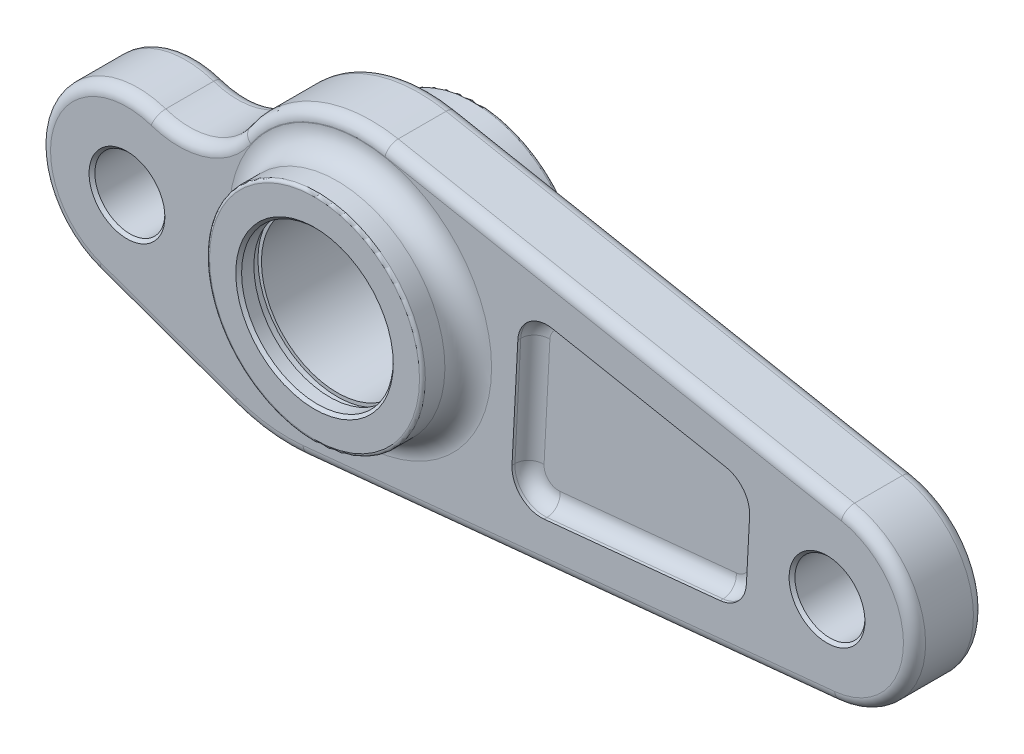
ISO-10303-21;
HEADER;
FILE_DESCRIPTION(('STEP AP214'),'2;1');
FILE_NAME('part.step','',(''),(''),'','','');
FILE_SCHEMA(('AUTOMOTIVE_DESIGN { 1 0 10303 214 1 1 1 1 }'));
ENDSEC;
DATA;
#1=APPLICATION_CONTEXT('core data for automotive mechanical design processes');
#2=APPLICATION_PROTOCOL_DEFINITION('international standard','automotive_design',2000,#1);
#3=PRODUCT_CONTEXT('',#1,'mechanical');
#4=PRODUCT('Part','Part','',(#3));
#5=PRODUCT_RELATED_PRODUCT_CATEGORY('part','',(#4));
#6=PRODUCT_DEFINITION_FORMATION('','',#4);
#7=PRODUCT_DEFINITION_CONTEXT('part definition',#1,'design');
#8=PRODUCT_DEFINITION('design','',#6,#7);
#9=PRODUCT_DEFINITION_SHAPE('','',#8);
#10=(LENGTH_UNIT() NAMED_UNIT(*) SI_UNIT(.MILLI.,.METRE.));
#11=(NAMED_UNIT(*) PLANE_ANGLE_UNIT() SI_UNIT($,.RADIAN.));
#12=(NAMED_UNIT(*) SI_UNIT($,.STERADIAN.) SOLID_ANGLE_UNIT());
#13=UNCERTAINTY_MEASURE_WITH_UNIT(LENGTH_MEASURE(1.E-05),#10,'distance_accuracy_value','');
#14=(GEOMETRIC_REPRESENTATION_CONTEXT(3) GLOBAL_UNCERTAINTY_ASSIGNED_CONTEXT((#13)) GLOBAL_UNIT_ASSIGNED_CONTEXT((#10,
#11,#12)) REPRESENTATION_CONTEXT('',''));
#15=CARTESIAN_POINT('',(0.,0.,0.));
#16=DIRECTION('',(0.,0.,1.));
#17=DIRECTION('',(1.,0.,0.));
#18=AXIS2_PLACEMENT_3D('',#15,#16,#17);
#19=CARTESIAN_POINT('',(0.,0.,17.25));
#20=DIRECTION('',(0.,0.,-1.));
#21=DIRECTION('',(-1.,0.,0.));
#22=AXIS2_PLACEMENT_3D('',#19,#20,#21);
#23=CYLINDRICAL_SURFACE('',#22,13.6);
#24=CARTESIAN_POINT('',(0.,0.,17.25));
#25=DIRECTION('',(0.,0.,-1.));
#26=DIRECTION('',(-1.,0.,0.));
#27=AXIS2_PLACEMENT_3D('',#24,#25,#26);
#28=CIRCLE('',#27,13.6);
#29=CARTESIAN_POINT('',(-13.6,0.,17.25));
#30=VERTEX_POINT('',#29);
#31=EDGE_CURVE('E1018',#30,#30,#28,.T.);
#32=ORIENTED_EDGE('',*,*,#31,.F.);
#33=EDGE_LOOP('',(#32));
#34=FACE_BOUND('',#33,.T.);
#35=CARTESIAN_POINT('',(0.,0.,15.95));
#36=DIRECTION('',(0.,0.,-1.));
#37=DIRECTION('',(-1.,0.,0.));
#38=AXIS2_PLACEMENT_3D('',#35,#36,#37);
#39=CIRCLE('',#38,13.6);
#40=CARTESIAN_POINT('',(-13.6,0.,15.95));
#41=VERTEX_POINT('',#40);
#42=EDGE_CURVE('E1015',#41,#41,#39,.T.);
#43=ORIENTED_EDGE('',*,*,#42,.T.);
#44=EDGE_LOOP('',(#43));
#45=FACE_BOUND('',#44,.T.);
#46=ADVANCED_FACE('F16',(#34,#45),#23,.F.);
#47=CARTESIAN_POINT('',(0.,0.,17.25));
#48=DIRECTION('',(0.,0.,-1.));
#49=DIRECTION('',(-1.,0.,0.));
#50=AXIS2_PLACEMENT_3D('',#47,#48,#49);
#51=PLANE('',#50);
#52=CARTESIAN_POINT('',(0.,0.,17.25));
#53=DIRECTION('',(0.,0.,-1.));
#54=DIRECTION('',(-1.,0.,0.));
#55=AXIS2_PLACEMENT_3D('',#52,#53,#54);
#56=CIRCLE('',#55,13.);
#57=CARTESIAN_POINT('',(-13.,0.,17.25));
#58=VERTEX_POINT('',#57);
#59=EDGE_CURVE('E1012',#58,#58,#56,.F.);
#60=ORIENTED_EDGE('',*,*,#59,.T.);
#61=EDGE_LOOP('',(#60));
#62=FACE_BOUND('',#61,.T.);
#63=ORIENTED_EDGE('',*,*,#31,.T.);
#64=EDGE_LOOP('',(#63));
#65=FACE_BOUND('',#64,.T.);
#66=ADVANCED_FACE('F1346',(#62,#65),#51,.T.);
#67=CARTESIAN_POINT('',(0.,0.,15.95));
#68=DIRECTION('',(0.,0.,-1.));
#69=DIRECTION('',(-1.,0.,0.));
#70=AXIS2_PLACEMENT_3D('',#67,#68,#69);
#71=PLANE('',#70);
#72=CARTESIAN_POINT('',(0.,0.,15.95));
#73=DIRECTION('',(0.,0.,-1.));
#74=DIRECTION('',(-1.,0.,0.));
#75=AXIS2_PLACEMENT_3D('',#72,#73,#74);
#76=CIRCLE('',#75,13.);
#77=CARTESIAN_POINT('',(-13.,0.,15.95));
#78=VERTEX_POINT('',#77);
#79=EDGE_CURVE('E1009',#78,#78,#76,.T.);
#80=ORIENTED_EDGE('',*,*,#79,.T.);
#81=EDGE_LOOP('',(#80));
#82=FACE_BOUND('',#81,.T.);
#83=ORIENTED_EDGE('',*,*,#42,.F.);
#84=EDGE_LOOP('',(#83));
#85=FACE_BOUND('',#84,.T.);
#86=ADVANCED_FACE('F1343',(#82,#85),#71,.F.);
#87=CARTESIAN_POINT('',(0.,0.,19.35));
#88=DIRECTION('',(0.,0.,-1.));
#89=DIRECTION('',(-1.,0.,0.));
#90=AXIS2_PLACEMENT_3D('',#87,#88,#89);
#91=CYLINDRICAL_SURFACE('',#90,13.);
#92=CARTESIAN_POINT('',(0.,0.,19.35));
#93=DIRECTION('',(0.,0.,1.));
#94=DIRECTION('',(1.,0.,0.));
#95=AXIS2_PLACEMENT_3D('',#92,#93,#94);
#96=CIRCLE('',#95,13.);
#97=CARTESIAN_POINT('',(13.,0.,19.35));
#98=VERTEX_POINT('',#97);
#99=EDGE_CURVE('E1008',#98,#98,#96,.T.);
#100=ORIENTED_EDGE('',*,*,#99,.T.);
#101=EDGE_LOOP('',(#100));
#102=FACE_BOUND('',#101,.T.);
#103=ORIENTED_EDGE('',*,*,#59,.F.);
#104=EDGE_LOOP('',(#103));
#105=FACE_BOUND('',#104,.T.);
#106=ADVANCED_FACE('F1324',(#102,#105),#91,.F.);
#107=CARTESIAN_POINT('',(0.,0.,15.95));
#108=DIRECTION('',(0.,0.,-1.));
#109=DIRECTION('',(-1.,0.,0.));
#110=AXIS2_PLACEMENT_3D('',#107,#108,#109);
#111=CYLINDRICAL_SURFACE('',#110,13.);
#112=ORIENTED_EDGE('',*,*,#79,.F.);
#113=EDGE_LOOP('',(#112));
#114=FACE_BOUND('',#113,.T.);
#115=CARTESIAN_POINT('',(0.,0.,-3.65));
#116=DIRECTION('',(0.,0.,-1.));
#117=DIRECTION('',(-1.,0.,0.));
#118=AXIS2_PLACEMENT_3D('',#115,#116,#117);
#119=CIRCLE('',#118,13.);
#120=CARTESIAN_POINT('',(-13.,0.,-3.65));
#121=VERTEX_POINT('',#120);
#122=EDGE_CURVE('E1003',#121,#121,#119,.F.);
#123=ORIENTED_EDGE('',*,*,#122,.F.);
#124=EDGE_LOOP('',(#123));
#125=FACE_BOUND('',#124,.T.);
#126=ADVANCED_FACE('F1330',(#114,#125),#111,.F.);
#127=CARTESIAN_POINT('',(0.,0.,19.85));
#128=DIRECTION('',(0.,0.,1.));
#129=DIRECTION('',(1.,0.,0.));
#130=AXIS2_PLACEMENT_3D('',#127,#128,#129);
#131=CONICAL_SURFACE('',#130,13.5,0.785398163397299);
#132=ORIENTED_EDGE('',*,*,#99,.F.);
#133=EDGE_LOOP('',(#132));
#134=FACE_BOUND('',#133,.T.);
#135=CARTESIAN_POINT('',(0.,0.,19.85));
#136=DIRECTION('',(0.,0.,1.));
#137=DIRECTION('',(1.,0.,0.));
#138=AXIS2_PLACEMENT_3D('',#135,#136,#137);
#139=CIRCLE('',#138,13.5);
#140=CARTESIAN_POINT('',(13.5,0.,19.85));
#141=VERTEX_POINT('',#140);
#142=EDGE_CURVE('E998',#141,#141,#139,.F.);
#143=ORIENTED_EDGE('',*,*,#142,.F.);
#144=EDGE_LOOP('',(#143));
#145=FACE_BOUND('',#144,.T.);
#146=ADVANCED_FACE('F1327',(#134,#145),#131,.F.);
#147=CARTESIAN_POINT('',(0.,0.,-3.65));
#148=DIRECTION('',(0.,0.,-1.));
#149=DIRECTION('',(-1.,0.,0.));
#150=AXIS2_PLACEMENT_3D('',#147,#148,#149);
#151=PLANE('',#150);
#152=ORIENTED_EDGE('',*,*,#122,.T.);
#153=EDGE_LOOP('',(#152));
#154=FACE_BOUND('',#153,.T.);
#155=CARTESIAN_POINT('',(0.,0.,-3.65));
#156=DIRECTION('',(0.,0.,-1.));
#157=DIRECTION('',(-1.,0.,0.));
#158=AXIS2_PLACEMENT_3D('',#155,#156,#157);
#159=CIRCLE('',#158,13.6);
#160=CARTESIAN_POINT('',(-13.6,0.,-3.65));
#161=VERTEX_POINT('',#160);
#162=EDGE_CURVE('E996',#161,#161,#159,.T.);
#163=ORIENTED_EDGE('',*,*,#162,.T.);
#164=EDGE_LOOP('',(#163));
#165=FACE_BOUND('',#164,.T.);
#166=ADVANCED_FACE('F977',(#154,#165),#151,.T.);
#167=CARTESIAN_POINT('',(0.,0.,19.85));
#168=DIRECTION('',(0.,0.,1.));
#169=DIRECTION('',(1.,0.,0.));
#170=AXIS2_PLACEMENT_3D('',#167,#168,#169);
#171=PLANE('',#170);
#172=ORIENTED_EDGE('',*,*,#142,.T.);
#173=EDGE_LOOP('',(#172));
#174=FACE_BOUND('',#173,.T.);
#175=CARTESIAN_POINT('',(0.,0.,19.8499999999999));
#176=DIRECTION('',(0.,0.,-1.));
#177=DIRECTION('',(-1.,0.,0.));
#178=AXIS2_PLACEMENT_3D('',#175,#176,#177);
#179=CIRCLE('',#178,17.9999996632);
#180=CARTESIAN_POINT('',(-17.99999946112,0.,19.8499999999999));
#181=VERTEX_POINT('',#180);
#182=CARTESIAN_POINT('',(17.99999946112,0.,19.8499999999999));
#183=VERTEX_POINT('',#182);
#184=EDGE_CURVE('E990',#181,#183,#179,.T.);
#185=ORIENTED_EDGE('',*,*,#184,.F.);
#186=CARTESIAN_POINT('',(0.,0.,19.8499999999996));
#187=DIRECTION('',(0.,0.,-1.));
#188=DIRECTION('',(1.,0.,0.));
#189=AXIS2_PLACEMENT_3D('',#186,#187,#188);
#190=CIRCLE('',#189,17.9999993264);
#191=EDGE_CURVE('E152',#183,#181,#190,.T.);
#192=ORIENTED_EDGE('',*,*,#191,.F.);
#193=EDGE_LOOP('',(#185,#192));
#194=FACE_BOUND('',#193,.T.);
#195=ADVANCED_FACE('F967',(#174,#194),#171,.T.);
#196=CARTESIAN_POINT('',(0.,0.,-3.65));
#197=DIRECTION('',(0.,0.,-1.));
#198=DIRECTION('',(-1.,0.,0.));
#199=AXIS2_PLACEMENT_3D('',#196,#197,#198);
#200=CYLINDRICAL_SURFACE('',#199,13.6);
#201=ORIENTED_EDGE('',*,*,#162,.F.);
#202=EDGE_LOOP('',(#201));
#203=FACE_BOUND('',#202,.T.);
#204=CARTESIAN_POINT('',(0.,0.,-4.95));
#205=DIRECTION('',(0.,0.,-1.));
#206=DIRECTION('',(-1.,0.,0.));
#207=AXIS2_PLACEMENT_3D('',#204,#205,#206);
#208=CIRCLE('',#207,13.6);
#209=CARTESIAN_POINT('',(-13.6,0.,-4.95));
#210=VERTEX_POINT('',#209);
#211=EDGE_CURVE('E992',#210,#210,#208,.T.);
#212=ORIENTED_EDGE('',*,*,#211,.T.);
#213=EDGE_LOOP('',(#212));
#214=FACE_BOUND('',#213,.T.);
#215=ADVANCED_FACE('F976',(#203,#214),#200,.F.);
#216=CARTESIAN_POINT('',(0.,0.,19.35));
#217=DIRECTION('',(0.,0.,1.));
#218=DIRECTION('',(0.999909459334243,-0.0134563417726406,0.));
#219=AXIS2_PLACEMENT_3D('',#216,#217,#218);
#220=TOROIDAL_SURFACE('',#219,18.,0.5);
#221=CARTESIAN_POINT('',(0.,0.,19.35));
#222=DIRECTION('',(0.,0.,1.));
#223=DIRECTION('',(1.,0.,0.));
#224=AXIS2_PLACEMENT_3D('',#221,#222,#223);
#225=CIRCLE('',#224,18.5);
#226=CARTESIAN_POINT('',(18.5,0.,19.35));
#227=VERTEX_POINT('',#226);
#228=EDGE_CURVE('E994',#227,#227,#225,.F.);
#229=ORIENTED_EDGE('',*,*,#228,.F.);
#230=EDGE_LOOP('',(#229));
#231=FACE_BOUND('',#230,.T.);
#232=ORIENTED_EDGE('',*,*,#184,.T.);
#233=ORIENTED_EDGE('',*,*,#191,.T.);
#234=EDGE_LOOP('',(#232,#233));
#235=FACE_BOUND('',#234,.T.);
#236=ADVANCED_FACE('F941',(#231,#235),#220,.T.);
#237=CARTESIAN_POINT('',(0.,0.,9.));
#238=DIRECTION('',(0.,0.,-1.));
#239=DIRECTION('',(-1.,0.,0.));
#240=AXIS2_PLACEMENT_3D('',#237,#238,#239);
#241=PLANE('',#240);
#242=DIRECTION('',(0.0523359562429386,0.998629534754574,0.));
#243=VECTOR('',#242,1.);
#244=CARTESIAN_POINT('',(28.483546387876,-13.1256965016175,9.0000000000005));
#245=LINE('',#244,#243);
#246=CARTESIAN_POINT('',(29.4978594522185,6.22856482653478,9.00000000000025));
#247=VERTEX_POINT('',#246);
#248=CARTESIAN_POINT('',(28.49657462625,-12.8770878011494,9.00000000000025));
#249=VERTEX_POINT('',#248);
#250=EDGE_CURVE('E147',#247,#249,#245,.F.);
#251=ORIENTED_EDGE('',*,*,#250,.T.);
#252=CARTESIAN_POINT('',(31.24014514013,-15.49569457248,9.));
#253=CARTESIAN_POINT('',(30.6961917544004,-15.5495810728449,9.));
#254=CARTESIAN_POINT('',(30.1793315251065,-15.3717582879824,9.));
#255=CARTESIAN_POINT('',(29.6629428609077,-15.1940977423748,9.));
#256=CARTESIAN_POINT('',(29.2670474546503,-14.8163993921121,9.));
#257=CARTESIAN_POINT('',(28.8719247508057,-14.4394382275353,9.));
#258=CARTESIAN_POINT('',(28.6697934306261,-13.9309763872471,9.));
#259=CARTESIAN_POINT('',(28.4680573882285,-13.4235088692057,9.));
#260=CARTESIAN_POINT('',(28.49657383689,-12.87708775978,9.));
#261=B_SPLINE_CURVE_WITH_KNOTS('',2,(#252,#253,#254,#255,#256,#257,#258,#259,#260),
.UNSPECIFIED.,.F.,.F.,(3,2,2,2,3),(0.,0.25,0.5,0.75,1.),.UNSPECIFIED.);
#262=CARTESIAN_POINT('',(31.2401452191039,-15.4956953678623,9.00000000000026));
#263=VERTEX_POINT('',#262);
#264=EDGE_CURVE('E912',#249,#263,#261,.F.);
#265=ORIENTED_EDGE('',*,*,#264,.T.);
#266=DIRECTION('',(-0.995107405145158,-0.0987990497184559,0.));
#267=VECTOR('',#266,1.);
#268=CARTESIAN_POINT('',(61.6861780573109,-12.4728659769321,9.00000000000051));
#269=LINE('',#268,#267);
#270=CARTESIAN_POINT('',(61.4384463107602,-12.4974627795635,9.00000000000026));
#271=VERTEX_POINT('',#270);
#272=EDGE_CURVE('E1261',#263,#271,#269,.F.);
#273=ORIENTED_EDGE('',*,*,#272,.T.);
#274=CARTESIAN_POINT('',(63.68802148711,-10.14053489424,9.));
#275=CARTESIAN_POINT('',(63.6652452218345,-10.5733728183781,9.));
#276=CARTESIAN_POINT('',(63.4982684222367,-10.9733224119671,9.));
#277=CARTESIAN_POINT('',(63.3200112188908,-11.4002912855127,9.));
#278=CARTESIAN_POINT('',(62.999920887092,-11.7357959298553,9.));
#279=CARTESIAN_POINT('',(62.6805328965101,-12.070564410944,9.));
#280=CARTESIAN_POINT('',(62.2614902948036,-12.2691217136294,9.));
#281=CARTESIAN_POINT('',(61.8702663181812,-12.4544975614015,9.));
#282=CARTESIAN_POINT('',(61.43844638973,-12.49746357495,9.));
#283=B_SPLINE_CURVE_WITH_KNOTS('',2,(#274,#275,#276,#277,#278,#279,#280,#281,#282),
.UNSPECIFIED.,.F.,.F.,(3,2,2,2,3),(0.,0.25,0.5,0.75,1.),.UNSPECIFIED.);
#284=CARTESIAN_POINT('',(63.6880220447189,-10.1405349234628,9.00000000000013));
#285=VERTEX_POINT('',#284);
#286=EDGE_CURVE('E918',#271,#285,#283,.F.);
#287=ORIENTED_EDGE('',*,*,#286,.T.);
#288=DIRECTION('',(-0.0523359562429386,-0.998629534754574,0.));
#289=VECTOR('',#288,1.);
#290=CARTESIAN_POINT('',(64.2470473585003,0.526314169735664,9.00000000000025));
#291=LINE('',#290,#289);
#292=CARTESIAN_POINT('',(64.2340188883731,0.277705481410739,9.00000000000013));
#293=VERTEX_POINT('',#292);
#294=EDGE_CURVE('E1280',#285,#293,#291,.F.);
#295=ORIENTED_EDGE('',*,*,#294,.T.);
#296=CARTESIAN_POINT('',(62.20712528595,2.864029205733,9.));
#297=CARTESIAN_POINT('',(62.6369816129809,2.78171293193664,9.));
#298=CARTESIAN_POINT('',(63.0134100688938,2.55840871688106,9.));
#299=CARTESIAN_POINT('',(63.4158250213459,2.31968883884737,9.));
#300=CARTESIAN_POINT('',(63.7051678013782,1.95064331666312,9.));
#301=CARTESIAN_POINT('',(63.9938588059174,1.58242910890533,9.));
#302=CARTESIAN_POINT('',(64.1299742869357,1.13366902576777,9.));
#303=CARTESIAN_POINT('',(64.2568616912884,0.715333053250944,9.));
#304=CARTESIAN_POINT('',(64.23401944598,0.2777054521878,9.));
#305=B_SPLINE_CURVE_WITH_KNOTS('',2,(#296,#297,#298,#299,#300,#301,#302,#303,#304),
.UNSPECIFIED.,.F.,.F.,(3,2,2,2,3),(0.,0.25,0.5,0.75,1.),.UNSPECIFIED.);
#306=CARTESIAN_POINT('',(62.207125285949,2.86402920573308,9.));
#307=VERTEX_POINT('',#306);
#308=EDGE_CURVE('E950',#293,#307,#305,.F.);
#309=ORIENTED_EDGE('',*,*,#308,.T.);
#310=DIRECTION('',(0.982193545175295,-0.187871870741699,0.));
#311=VECTOR('',#310,1.);
#312=CARTESIAN_POINT('',(32.2195952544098,8.59997951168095,9.));
#313=LINE('',#312,#311);
#314=CARTESIAN_POINT('',(32.4641121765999,8.55320884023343,9.));
#315=VERTEX_POINT('',#314);
#316=EDGE_CURVE('E1296',#307,#315,#313,.F.);
#317=ORIENTED_EDGE('',*,*,#316,.T.);
#318=CARTESIAN_POINT('',(29.49786024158,6.228564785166,9.));
#319=CARTESIAN_POINT('',(29.526323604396,6.76960489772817,9.));
#320=CARTESIAN_POINT('',(29.7760441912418,7.25043717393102,9.));
#321=CARTESIAN_POINT('',(30.0255345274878,7.73082610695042,9.));
#322=CARTESIAN_POINT('',(30.4523351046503,8.06544643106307,9.));
#323=CARTESIAN_POINT('',(30.8783283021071,8.39943375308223,9.));
#324=CARTESIAN_POINT('',(31.4053674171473,8.52733323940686,9.));
#325=CARTESIAN_POINT('',(31.9314116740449,8.65499129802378,9.));
#326=CARTESIAN_POINT('',(32.4641121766,8.553208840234,9.));
#327=B_SPLINE_CURVE_WITH_KNOTS('',2,(#318,#319,#320,#321,#322,#323,#324,#325,#326),
.UNSPECIFIED.,.F.,.F.,(3,2,2,2,3),(0.,0.25,0.5,0.75,1.),.UNSPECIFIED.);
#328=EDGE_CURVE('E139',#315,#247,#327,.F.);
#329=ORIENTED_EDGE('',*,*,#328,.T.);
#330=EDGE_LOOP('',(#251,#265,#273,#287,#295,#309,#317,#329));
#331=FACE_BOUND('',#330,.T.);
#332=ADVANCED_FACE('F931',(#331),#241,.F.);
#333=CARTESIAN_POINT('',(0.,0.,-4.95));
#334=DIRECTION('',(0.,0.,-1.));
#335=DIRECTION('',(-1.,0.,0.));
#336=AXIS2_PLACEMENT_3D('',#333,#334,#335);
#337=PLANE('',#336);
#338=CARTESIAN_POINT('',(0.,0.,-4.95));
#339=DIRECTION('',(0.,0.,-1.));
#340=DIRECTION('',(-1.,0.,0.));
#341=AXIS2_PLACEMENT_3D('',#338,#339,#340);
#342=CIRCLE('',#341,13.);
#343=CARTESIAN_POINT('',(-13.,0.,-4.95));
#344=VERTEX_POINT('',#343);
#345=EDGE_CURVE('E907',#344,#344,#342,.T.);
#346=ORIENTED_EDGE('',*,*,#345,.T.);
#347=EDGE_LOOP('',(#346));
#348=FACE_BOUND('',#347,.T.);
#349=ORIENTED_EDGE('',*,*,#211,.F.);
#350=EDGE_LOOP('',(#349));
#351=FACE_BOUND('',#350,.T.);
#352=ADVANCED_FACE('F940',(#348,#351),#337,.F.);
#353=CARTESIAN_POINT('',(0.,0.,16.));
#354=DIRECTION('',(0.,0.,1.));
#355=DIRECTION('',(1.,0.,0.));
#356=AXIS2_PLACEMENT_3D('',#353,#354,#355);
#357=CYLINDRICAL_SURFACE('',#356,18.5);
#358=CARTESIAN_POINT('',(0.,0.,16.));
#359=DIRECTION('',(0.,0.,1.));
#360=DIRECTION('',(0.999909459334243,-0.0134563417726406,0.));
#361=AXIS2_PLACEMENT_3D('',#358,#359,#360);
#362=CIRCLE('',#361,18.5);
#363=CARTESIAN_POINT('',(18.4983249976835,-0.248942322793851,16.));
#364=VERTEX_POINT('',#363);
#365=EDGE_CURVE('E910',#364,#364,#362,.T.);
#366=ORIENTED_EDGE('',*,*,#365,.T.);
#367=EDGE_LOOP('',(#366));
#368=FACE_BOUND('',#367,.T.);
#369=ORIENTED_EDGE('',*,*,#228,.T.);
#370=EDGE_LOOP('',(#369));
#371=FACE_BOUND('',#370,.T.);
#372=ADVANCED_FACE('F1666',(#368,#371),#357,.T.);
#373=CARTESIAN_POINT('',(28.496573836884,-12.8770877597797,11.5));
#374=DIRECTION('',(0.0523359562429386,0.998629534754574,0.));
#375=DIRECTION('',(-0.998629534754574,0.0523359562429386,0.));
#376=AXIS2_PLACEMENT_3D('',#373,#374,#375);
#377=CYLINDRICAL_SURFACE('',#376,2.5);
#378=DIRECTION('',(-0.0523359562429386,-0.998629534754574,0.));
#379=VECTOR('',#378,1.);
#380=CARTESIAN_POINT('',(26.,-12.74624786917,11.5));
#381=LINE('',#380,#379);
#382=CARTESIAN_POINT('',(27.0012848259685,6.3594047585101,11.5));
#383=VERTEX_POINT('',#382);
#384=CARTESIAN_POINT('',(26.0000000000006,-12.7462478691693,11.5));
#385=VERTEX_POINT('',#384);
#386=EDGE_CURVE('E1235',#383,#385,#381,.T.);
#387=ORIENTED_EDGE('',*,*,#386,.T.);
#388=CARTESIAN_POINT('',(28.4965738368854,-12.8770877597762,11.4999999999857));
#389=DIRECTION('',(-0.0523359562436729,-0.998629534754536,2.01209660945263E-12));
#390=DIRECTION('',(0.998629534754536,-0.0523359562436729,0.));
#391=AXIS2_PLACEMENT_3D('',#388,#389,#390);
#392=CIRCLE('',#391,2.49999999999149);
#393=EDGE_CURVE('E911',#385,#249,#392,.T.);
#394=ORIENTED_EDGE('',*,*,#393,.T.);
#395=ORIENTED_EDGE('',*,*,#250,.F.);
#396=CARTESIAN_POINT('',(29.4978586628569,6.22856486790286,11.5000000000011));
#397=DIRECTION('',(0.052335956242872,0.998629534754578,2.43374501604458E-13));
#398=DIRECTION('',(-0.998629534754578,0.052335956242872,0.));
#399=AXIS2_PLACEMENT_3D('',#396,#397,#398);
#400=CIRCLE('',#399,2.50000000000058);
#401=EDGE_CURVE('E1299',#247,#383,#400,.T.);
#402=ORIENTED_EDGE('',*,*,#401,.T.);
#403=EDGE_LOOP('',(#387,#394,#395,#402));
#404=FACE_BOUND('',#403,.T.);
#405=ADVANCED_FACE('F1658',(#404),#377,.F.);
#406=CARTESIAN_POINT('',(31.9944324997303,6.09772497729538,11.5000000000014));
#407=DIRECTION('',(0.,0.,-1.));
#408=DIRECTION('',(-1.,0.,0.));
#409=AXIS2_PLACEMENT_3D('',#406,#407,#408);
#410=DEGENERATE_TOROIDAL_SURFACE('',#409,2.49999999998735,2.5000000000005,.T.);
#411=CARTESIAN_POINT('',(31.99443249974,6.097724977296,11.5));
#412=DIRECTION('',(0.,0.,-1.));
#413=DIRECTION('',(1.,0.,0.));
#414=AXIS2_PLACEMENT_3D('',#411,#412,#413);
#415=CIRCLE('',#414,5.);
#416=CARTESIAN_POINT('',(32.9337918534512,11.0086927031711,11.5));
#417=VERTEX_POINT('',#416);
#418=EDGE_CURVE('E1222',#417,#383,#415,.F.);
#419=ORIENTED_EDGE('',*,*,#418,.T.);
#420=ORIENTED_EDGE('',*,*,#401,.F.);
#421=ORIENTED_EDGE('',*,*,#328,.F.);
#422=CARTESIAN_POINT('',(32.4641121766,8.55320884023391,11.5));
#423=DIRECTION('',(0.982193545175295,-0.187871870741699,0.));
#424=DIRECTION('',(0.187871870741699,0.982193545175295,0.));
#425=AXIS2_PLACEMENT_3D('',#422,#423,#424);
#426=CIRCLE('',#425,2.5);
#427=EDGE_CURVE('E954',#315,#417,#426,.T.);
#428=ORIENTED_EDGE('',*,*,#427,.T.);
#429=EDGE_LOOP('',(#419,#420,#421,#428));
#430=FACE_BOUND('',#429,.T.);
#431=ADVANCED_FACE('F382',(#430),#410,.F.);
#432=CARTESIAN_POINT('',(32.4641121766,8.55320884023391,11.5));
#433=DIRECTION('',(0.982193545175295,-0.187871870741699,0.));
#434=DIRECTION('',(0.187871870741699,0.982193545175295,0.));
#435=AXIS2_PLACEMENT_3D('',#432,#433,#434);
#436=CYLINDRICAL_SURFACE('',#435,2.5);
#437=DIRECTION('',(-0.982193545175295,0.187871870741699,0.));
#438=VECTOR('',#437,1.);
#439=CARTESIAN_POINT('',(32.93379185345,11.00869270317,11.5));
#440=LINE('',#439,#438);
#441=CARTESIAN_POINT('',(62.6768049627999,5.31951306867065,11.5));
#442=VERTEX_POINT('',#441);
#443=EDGE_CURVE('E1216',#442,#417,#440,.T.);
#444=ORIENTED_EDGE('',*,*,#443,.T.);
#445=ORIENTED_EDGE('',*,*,#427,.F.);
#446=ORIENTED_EDGE('',*,*,#316,.F.);
#447=CARTESIAN_POINT('',(62.2071252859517,2.86402920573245,11.499999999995));
#448=DIRECTION('',(0.98219354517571,-0.187871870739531,-1.12553878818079E-12));
#449=DIRECTION('',(0.187871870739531,0.98219354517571,0.));
#450=AXIS2_PLACEMENT_3D('',#447,#448,#449);
#451=CIRCLE('',#450,2.49999999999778);
#452=EDGE_CURVE('E953',#307,#442,#451,.T.);
#453=ORIENTED_EDGE('',*,*,#452,.T.);
#454=EDGE_LOOP('',(#444,#445,#446,#453));
#455=FACE_BOUND('',#454,.T.);
#456=ADVANCED_FACE('F1633',(#455),#436,.F.);
#457=CARTESIAN_POINT('',(61.7374456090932,0.408545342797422,11.4999999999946));
#458=DIRECTION('',(0.,0.,-1.));
#459=DIRECTION('',(-1.,0.,0.));
#460=AXIS2_PLACEMENT_3D('',#457,#458,#459);
#461=DEGENERATE_TOROIDAL_SURFACE('',#460,2.49999999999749,2.49999999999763,.T.);
#462=CARTESIAN_POINT('',(61.73744560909,0.4085453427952,11.5));
#463=DIRECTION('',(0.,0.,-1.));
#464=DIRECTION('',(1.,0.,0.));
#465=AXIS2_PLACEMENT_3D('',#462,#463,#464);
#466=CIRCLE('',#465,5.);
#467=CARTESIAN_POINT('',(66.7305932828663,0.146865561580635,11.5));
#468=VERTEX_POINT('',#467);
#469=EDGE_CURVE('E1210',#468,#442,#466,.F.);
#470=ORIENTED_EDGE('',*,*,#469,.T.);
#471=ORIENTED_EDGE('',*,*,#452,.F.);
#472=ORIENTED_EDGE('',*,*,#308,.F.);
#473=CARTESIAN_POINT('',(64.2340194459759,0.277705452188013,11.5));
#474=DIRECTION('',(-0.0523359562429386,-0.998629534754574,0.));
#475=DIRECTION('',(0.998629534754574,-0.0523359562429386,0.));
#476=AXIS2_PLACEMENT_3D('',#473,#474,#475);
#477=CIRCLE('',#476,2.5);
#478=EDGE_CURVE('E1277',#293,#468,#477,.T.);
#479=ORIENTED_EDGE('',*,*,#478,.T.);
#480=EDGE_LOOP('',(#470,#471,#472,#479));
#481=FACE_BOUND('',#480,.T.);
#482=ADVANCED_FACE('F1627',(#481),#461,.F.);
#483=CARTESIAN_POINT('',(64.2340194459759,0.277705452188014,11.5));
#484=DIRECTION('',(-0.0523359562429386,-0.998629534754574,0.));
#485=DIRECTION('',(0.998629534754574,-0.0523359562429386,0.));
#486=AXIS2_PLACEMENT_3D('',#483,#484,#485);
#487=CYLINDRICAL_SURFACE('',#486,2.5);
#488=DIRECTION('',(0.0523359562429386,0.998629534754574,0.));
#489=VECTOR('',#488,1.);
#490=CARTESIAN_POINT('',(66.73059328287,0.1468655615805,11.5));
#491=LINE('',#490,#489);
#492=CARTESIAN_POINT('',(66.1845964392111,-10.2713748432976,11.5));
#493=VERTEX_POINT('',#492);
#494=EDGE_CURVE('E1204',#493,#468,#491,.T.);
#495=ORIENTED_EDGE('',*,*,#494,.T.);
#496=ORIENTED_EDGE('',*,*,#478,.F.);
#497=ORIENTED_EDGE('',*,*,#294,.F.);
#498=CARTESIAN_POINT('',(63.6880226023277,-10.1405349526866,11.4999999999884));
#499=DIRECTION('',(-0.052335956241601,-0.998629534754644,-2.83221794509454E-13));
#500=DIRECTION('',(0.998629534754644,-0.052335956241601,0.));
#501=AXIS2_PLACEMENT_3D('',#498,#499,#500);
#502=CIRCLE('',#501,2.4999999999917);
#503=EDGE_CURVE('E1268',#285,#493,#502,.T.);
#504=ORIENTED_EDGE('',*,*,#503,.T.);
#505=EDGE_LOOP('',(#495,#496,#497,#504));
#506=FACE_BOUND('',#505,.T.);
#507=ADVANCED_FACE('F1620',(#506),#487,.F.);
#508=CARTESIAN_POINT('',(61.1914487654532,-10.0096950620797,11.4999999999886));
#509=DIRECTION('',(0.,0.,-1.));
#510=DIRECTION('',(-1.,0.,0.));
#511=AXIS2_PLACEMENT_3D('',#508,#509,#510);
#512=DEGENERATE_TOROIDAL_SURFACE('',#511,2.49999999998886,2.49999999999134,.T.);
#513=CARTESIAN_POINT('',(61.19144876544,-10.00969506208,11.5));
#514=DIRECTION('',(0.,0.,-1.));
#515=DIRECTION('',(1.,0.,0.));
#516=AXIS2_PLACEMENT_3D('',#513,#514,#515);
#517=CIRCLE('',#516,5.);
#518=CARTESIAN_POINT('',(61.6854440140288,-14.9852320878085,11.5));
#519=VERTEX_POINT('',#518);
#520=EDGE_CURVE('E1198',#519,#493,#517,.F.);
#521=ORIENTED_EDGE('',*,*,#520,.T.);
#522=ORIENTED_EDGE('',*,*,#503,.F.);
#523=ORIENTED_EDGE('',*,*,#286,.F.);
#524=CARTESIAN_POINT('',(61.4384463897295,-12.4974635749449,11.5));
#525=DIRECTION('',(-0.995107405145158,-0.0987990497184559,0.));
#526=DIRECTION('',(0.0987990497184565,-0.995107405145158,0.));
#527=AXIS2_PLACEMENT_3D('',#524,#525,#526);
#528=CIRCLE('',#527,2.5);
#529=EDGE_CURVE('E917',#271,#519,#528,.T.);
#530=ORIENTED_EDGE('',*,*,#529,.T.);
#531=EDGE_LOOP('',(#521,#522,#523,#530));
#532=FACE_BOUND('',#531,.T.);
#533=ADVANCED_FACE('F1614',(#532),#512,.F.);
#534=CARTESIAN_POINT('',(61.4384463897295,-12.4974635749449,11.5));
#535=DIRECTION('',(-0.995107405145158,-0.0987990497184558,0.));
#536=DIRECTION('',(0.0987990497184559,-0.995107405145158,0.));
#537=AXIS2_PLACEMENT_3D('',#534,#535,#536);
#538=CYLINDRICAL_SURFACE('',#537,2.5);
#539=DIRECTION('',(0.995107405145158,0.0987990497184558,0.));
#540=VECTOR('',#539,1.);
#541=CARTESIAN_POINT('',(61.68544401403,-14.98523208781,11.5));
#542=LINE('',#541,#540);
#543=CARTESIAN_POINT('',(31.4871429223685,-17.9834646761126,11.5));
#544=VERTEX_POINT('',#543);
#545=EDGE_CURVE('E1192',#544,#519,#542,.T.);
#546=ORIENTED_EDGE('',*,*,#545,.T.);
#547=ORIENTED_EDGE('',*,*,#529,.F.);
#548=ORIENTED_EDGE('',*,*,#272,.F.);
#549=CARTESIAN_POINT('',(31.2401452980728,-15.4956961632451,11.4999999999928));
#550=DIRECTION('',(-0.995107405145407,-0.0987990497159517,-2.12003742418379E-13));
#551=DIRECTION('',(0.0987990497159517,-0.995107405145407,0.));
#552=AXIS2_PLACEMENT_3D('',#549,#550,#551);
#553=CIRCLE('',#552,2.49999999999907);
#554=EDGE_CURVE('E916',#263,#544,#553,.T.);
#555=ORIENTED_EDGE('',*,*,#554,.T.);
#556=EDGE_LOOP('',(#546,#547,#548,#555));
#557=FACE_BOUND('',#556,.T.);
#558=ADVANCED_FACE('F1606',(#557),#538,.F.);
#559=CARTESIAN_POINT('',(30.9931476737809,-13.0079276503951,11.4999999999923));
#560=DIRECTION('',(0.,0.,-1.));
#561=DIRECTION('',(-1.,0.,0.));
#562=AXIS2_PLACEMENT_3D('',#559,#560,#561);
#563=DEGENERATE_TOROIDAL_SURFACE('',#562,2.49999999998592,2.49999999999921,.T.);
#564=CARTESIAN_POINT('',(30.99314767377,-13.00792765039,11.5));
#565=DIRECTION('',(0.,0.,-1.));
#566=DIRECTION('',(1.,0.,0.));
#567=AXIS2_PLACEMENT_3D('',#564,#565,#566);
#568=CIRCLE('',#567,5.);
#569=EDGE_CURVE('E1181',#385,#544,#568,.F.);
#570=ORIENTED_EDGE('',*,*,#569,.T.);
#571=ORIENTED_EDGE('',*,*,#554,.F.);
#572=ORIENTED_EDGE('',*,*,#264,.F.);
#573=ORIENTED_EDGE('',*,*,#393,.F.);
#574=EDGE_LOOP('',(#570,#571,#572,#573));
#575=FACE_BOUND('',#574,.T.);
#576=ADVANCED_FACE('F1600',(#575),#563,.F.);
#577=CARTESIAN_POINT('',(0.,0.,-4.95));
#578=DIRECTION('',(0.,0.,-1.));
#579=DIRECTION('',(-1.,0.,0.));
#580=AXIS2_PLACEMENT_3D('',#577,#578,#579);
#581=CYLINDRICAL_SURFACE('',#580,13.);
#582=CARTESIAN_POINT('',(0.,0.,-7.34999999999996));
#583=DIRECTION('',(0.,0.,-1.));
#584=DIRECTION('',(-1.,0.,0.));
#585=AXIS2_PLACEMENT_3D('',#582,#583,#584);
#586=CIRCLE('',#585,13.);
#587=CARTESIAN_POINT('',(-13.,0.,-7.34999999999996));
#588=VERTEX_POINT('',#587);
#589=EDGE_CURVE('E1186',#588,#588,#586,.T.);
#590=ORIENTED_EDGE('',*,*,#589,.T.);
#591=EDGE_LOOP('',(#590));
#592=FACE_BOUND('',#591,.T.);
#593=ORIENTED_EDGE('',*,*,#345,.F.);
#594=EDGE_LOOP('',(#593));
#595=FACE_BOUND('',#594,.T.);
#596=ADVANCED_FACE('F1057',(#592,#595),#581,.F.);
#597=CARTESIAN_POINT('',(0.,0.,16.));
#598=DIRECTION('',(0.,0.,1.));
#599=DIRECTION('',(0.999909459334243,-0.0134563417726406,0.));
#600=AXIS2_PLACEMENT_3D('',#597,#598,#599);
#601=TOROIDAL_SURFACE('',#600,22.5,4.);
#602=ORIENTED_EDGE('',*,*,#365,.F.);
#603=EDGE_LOOP('',(#602));
#604=FACE_BOUND('',#603,.T.);
#605=CARTESIAN_POINT('',(0.,0.,12.0000000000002));
#606=DIRECTION('',(0.,0.,1.));
#607=DIRECTION('',(-1.,0.,0.));
#608=AXIS2_PLACEMENT_3D('',#605,#606,#607);
#609=CIRCLE('',#608,22.49999880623);
#610=CARTESIAN_POINT('',(22.499999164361,0.,12.));
#611=VERTEX_POINT('',#610);
#612=CARTESIAN_POINT('',(-22.499999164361,0.,12.));
#613=VERTEX_POINT('',#612);
#614=EDGE_CURVE('E1042',#611,#613,#609,.F.);
#615=ORIENTED_EDGE('',*,*,#614,.F.);
#616=CARTESIAN_POINT('',(0.,0.,12.));
#617=DIRECTION('',(0.,0.,1.));
#618=DIRECTION('',(1.,0.,0.));
#619=AXIS2_PLACEMENT_3D('',#616,#617,#618);
#620=CIRCLE('',#619,22.499999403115);
#621=EDGE_CURVE('E1122',#613,#611,#620,.F.);
#622=ORIENTED_EDGE('',*,*,#621,.F.);
#623=EDGE_LOOP('',(#615,#622));
#624=FACE_BOUND('',#623,.T.);
#625=ADVANCED_FACE('F1046',(#604,#624),#601,.F.);
#626=CARTESIAN_POINT('',(26.,-12.74624786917,9.));
#627=DIRECTION('',(-0.998629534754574,0.0523359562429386,0.));
#628=DIRECTION('',(-0.0523359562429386,-0.998629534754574,0.));
#629=AXIS2_PLACEMENT_3D('',#626,#627,#628);
#630=PLANE('',#629);
#631=DIRECTION('',(0.0523359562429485,0.998629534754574,0.));
#632=VECTOR('',#631,1.);
#633=CARTESIAN_POINT('',(26.,-12.74624786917,12.));
#634=LINE('',#633,#632);
#635=CARTESIAN_POINT('',(25.9999999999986,-12.7462478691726,12.));
#636=VERTEX_POINT('',#635);
#637=CARTESIAN_POINT('',(27.0012848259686,6.35940475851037,12.));
#638=VERTEX_POINT('',#637);
#639=EDGE_CURVE('E906',#636,#638,#634,.T.);
#640=ORIENTED_EDGE('',*,*,#639,.F.);
#641=DIRECTION('',(0.,0.,-1.));
#642=VECTOR('',#641,1.);
#643=CARTESIAN_POINT('',(25.9999999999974,-12.7462478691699,9.));
#644=LINE('',#643,#642);
#645=EDGE_CURVE('E1180',#636,#385,#644,.T.);
#646=ORIENTED_EDGE('',*,*,#645,.T.);
#647=ORIENTED_EDGE('',*,*,#386,.F.);
#648=DIRECTION('',(0.,0.,-1.));
#649=VECTOR('',#648,1.);
#650=CARTESIAN_POINT('',(27.0012848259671,6.35940475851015,9.));
#651=LINE('',#650,#649);
#652=EDGE_CURVE('E1219',#383,#638,#651,.F.);
#653=ORIENTED_EDGE('',*,*,#652,.T.);
#654=EDGE_LOOP('',(#640,#646,#647,#653));
#655=FACE_BOUND('',#654,.T.);
#656=ADVANCED_FACE('F1056',(#655),#630,.F.);
#657=CARTESIAN_POINT('',(31.99443249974,6.097724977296,12.));
#658=DIRECTION('',(0.,0.,-1.));
#659=DIRECTION('',(-1.,0.,0.));
#660=AXIS2_PLACEMENT_3D('',#657,#658,#659);
#661=CYLINDRICAL_SURFACE('',#660,5.);
#662=CARTESIAN_POINT('',(31.99443249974,6.097724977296,12.));
#663=DIRECTION('',(0.,0.,-1.));
#664=DIRECTION('',(-1.,0.,0.));
#665=AXIS2_PLACEMENT_3D('',#662,#663,#664);
#666=CIRCLE('',#665,5.);
#667=CARTESIAN_POINT('',(32.9337918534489,11.0086927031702,12.));
#668=VERTEX_POINT('',#667);
#669=EDGE_CURVE('E904',#638,#668,#666,.T.);
#670=ORIENTED_EDGE('',*,*,#669,.F.);
#671=ORIENTED_EDGE('',*,*,#652,.F.);
#672=ORIENTED_EDGE('',*,*,#418,.F.);
#673=DIRECTION('',(0.,0.,1.));
#674=VECTOR('',#673,1.);
#675=CARTESIAN_POINT('',(32.93379185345,11.00869270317,9.));
#676=LINE('',#675,#674);
#677=EDGE_CURVE('E1213',#417,#668,#676,.T.);
#678=ORIENTED_EDGE('',*,*,#677,.T.);
#679=EDGE_LOOP('',(#670,#671,#672,#678));
#680=FACE_BOUND('',#679,.T.);
#681=ADVANCED_FACE('F1682',(#680),#661,.F.);
#682=CARTESIAN_POINT('',(32.93379185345,11.00869270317,9.));
#683=DIRECTION('',(0.187871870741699,0.982193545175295,0.));
#684=DIRECTION('',(-0.982193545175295,0.187871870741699,0.));
#685=AXIS2_PLACEMENT_3D('',#682,#683,#684);
#686=PLANE('',#685);
#687=DIRECTION('',(0.982193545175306,-0.187871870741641,0.));
#688=VECTOR('',#687,1.);
#689=CARTESIAN_POINT('',(32.93379185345,11.00869270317,12.));
#690=LINE('',#689,#688);
#691=CARTESIAN_POINT('',(62.6768049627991,5.31951306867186,12.));
#692=VERTEX_POINT('',#691);
#693=EDGE_CURVE('E903',#668,#692,#690,.T.);
#694=ORIENTED_EDGE('',*,*,#693,.F.);
#695=ORIENTED_EDGE('',*,*,#677,.F.);
#696=ORIENTED_EDGE('',*,*,#443,.F.);
#697=DIRECTION('',(0.,0.,-1.));
#698=VECTOR('',#697,1.);
#699=CARTESIAN_POINT('',(62.6768049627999,5.31951306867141,9.));
#700=LINE('',#699,#698);
#701=EDGE_CURVE('E1207',#442,#692,#700,.F.);
#702=ORIENTED_EDGE('',*,*,#701,.T.);
#703=EDGE_LOOP('',(#694,#695,#696,#702));
#704=FACE_BOUND('',#703,.T.);
#705=ADVANCED_FACE('F1691',(#704),#686,.F.);
#706=CARTESIAN_POINT('',(61.73744560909,0.4085453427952,12.));
#707=DIRECTION('',(0.,0.,-1.));
#708=DIRECTION('',(-1.,0.,0.));
#709=AXIS2_PLACEMENT_3D('',#706,#707,#708);
#710=CYLINDRICAL_SURFACE('',#709,5.);
#711=CARTESIAN_POINT('',(61.73744560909,0.4085453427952,12.));
#712=DIRECTION('',(0.,0.,-1.));
#713=DIRECTION('',(-1.,0.,0.));
#714=AXIS2_PLACEMENT_3D('',#711,#712,#713);
#715=CIRCLE('',#714,5.);
#716=CARTESIAN_POINT('',(66.73059328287,0.146865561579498,12.));
#717=VERTEX_POINT('',#716);
#718=EDGE_CURVE('E901',#692,#717,#715,.T.);
#719=ORIENTED_EDGE('',*,*,#718,.F.);
#720=ORIENTED_EDGE('',*,*,#701,.F.);
#721=ORIENTED_EDGE('',*,*,#469,.F.);
#722=DIRECTION('',(0.,0.,1.));
#723=VECTOR('',#722,1.);
#724=CARTESIAN_POINT('',(66.73059328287,0.1468655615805,9.));
#725=LINE('',#724,#723);
#726=EDGE_CURVE('E1201',#468,#717,#725,.T.);
#727=ORIENTED_EDGE('',*,*,#726,.T.);
#728=EDGE_LOOP('',(#719,#720,#721,#727));
#729=FACE_BOUND('',#728,.T.);
#730=ADVANCED_FACE('F1700',(#729),#710,.F.);
#731=CARTESIAN_POINT('',(66.73059328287,0.1468655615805,9.));
#732=DIRECTION('',(0.998629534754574,-0.0523359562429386,0.));
#733=DIRECTION('',(0.0523359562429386,0.998629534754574,0.));
#734=AXIS2_PLACEMENT_3D('',#731,#732,#733);
#735=PLANE('',#734);
#736=DIRECTION('',(-0.052335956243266,-0.998629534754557,0.));
#737=VECTOR('',#736,1.);
#738=CARTESIAN_POINT('',(66.73059328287,0.1468655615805,12.));
#739=LINE('',#738,#737);
#740=CARTESIAN_POINT('',(66.1845964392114,-10.2713748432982,12.));
#741=VERTEX_POINT('',#740);
#742=EDGE_CURVE('E900',#717,#741,#739,.T.);
#743=ORIENTED_EDGE('',*,*,#742,.F.);
#744=ORIENTED_EDGE('',*,*,#726,.F.);
#745=ORIENTED_EDGE('',*,*,#494,.F.);
#746=DIRECTION('',(0.,0.,-1.));
#747=VECTOR('',#746,1.);
#748=CARTESIAN_POINT('',(66.1845964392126,-10.2713748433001,9.));
#749=LINE('',#748,#747);
#750=EDGE_CURVE('E1195',#493,#741,#749,.F.);
#751=ORIENTED_EDGE('',*,*,#750,.T.);
#752=EDGE_LOOP('',(#743,#744,#745,#751));
#753=FACE_BOUND('',#752,.T.);
#754=ADVANCED_FACE('F1710',(#753),#735,.F.);
#755=CARTESIAN_POINT('',(61.19144876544,-10.00969506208,12.));
#756=DIRECTION('',(0.,0.,-1.));
#757=DIRECTION('',(-1.,0.,0.));
#758=AXIS2_PLACEMENT_3D('',#755,#756,#757);
#759=CYLINDRICAL_SURFACE('',#758,5.);
#760=CARTESIAN_POINT('',(61.19144876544,-10.00969506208,12.));
#761=DIRECTION('',(0.,0.,-1.));
#762=DIRECTION('',(-1.,0.,0.));
#763=AXIS2_PLACEMENT_3D('',#760,#761,#762);
#764=CIRCLE('',#763,5.);
#765=CARTESIAN_POINT('',(61.6854440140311,-14.9852320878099,12.));
#766=VERTEX_POINT('',#765);
#767=EDGE_CURVE('E898',#741,#766,#764,.T.);
#768=ORIENTED_EDGE('',*,*,#767,.F.);
#769=ORIENTED_EDGE('',*,*,#750,.F.);
#770=ORIENTED_EDGE('',*,*,#520,.F.);
#771=DIRECTION('',(0.,0.,1.));
#772=VECTOR('',#771,1.);
#773=CARTESIAN_POINT('',(61.68544401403,-14.98523208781,9.));
#774=LINE('',#773,#772);
#775=EDGE_CURVE('E1189',#519,#766,#774,.T.);
#776=ORIENTED_EDGE('',*,*,#775,.T.);
#777=EDGE_LOOP('',(#768,#769,#770,#776));
#778=FACE_BOUND('',#777,.T.);
#779=ADVANCED_FACE('F1720',(#778),#759,.F.);
#780=CARTESIAN_POINT('',(61.68544401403,-14.98523208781,9.));
#781=DIRECTION('',(0.0987990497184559,-0.995107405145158,0.));
#782=DIRECTION('',(0.995107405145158,0.0987990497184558,0.));
#783=AXIS2_PLACEMENT_3D('',#780,#781,#782);
#784=PLANE('',#783);
#785=DIRECTION('',(-0.995107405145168,-0.0987990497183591,0.));
#786=VECTOR('',#785,1.);
#787=CARTESIAN_POINT('',(61.68544401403,-14.98523208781,12.));
#788=LINE('',#787,#786);
#789=CARTESIAN_POINT('',(31.4871429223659,-17.9834646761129,12.));
#790=VERTEX_POINT('',#789);
#791=EDGE_CURVE('E897',#766,#790,#788,.T.);
#792=ORIENTED_EDGE('',*,*,#791,.F.);
#793=ORIENTED_EDGE('',*,*,#775,.F.);
#794=ORIENTED_EDGE('',*,*,#545,.F.);
#795=DIRECTION('',(0.,0.,-1.));
#796=VECTOR('',#795,1.);
#797=CARTESIAN_POINT('',(31.4871429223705,-17.983464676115,9.));
#798=LINE('',#797,#796);
#799=EDGE_CURVE('E1172',#544,#790,#798,.F.);
#800=ORIENTED_EDGE('',*,*,#799,.T.);
#801=EDGE_LOOP('',(#792,#793,#794,#800));
#802=FACE_BOUND('',#801,.T.);
#803=ADVANCED_FACE('F1730',(#802),#784,.F.);
#804=CARTESIAN_POINT('',(30.99314767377,-13.00792765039,12.));
#805=DIRECTION('',(0.,0.,-1.));
#806=DIRECTION('',(-1.,0.,0.));
#807=AXIS2_PLACEMENT_3D('',#804,#805,#806);
#808=CYLINDRICAL_SURFACE('',#807,5.);
#809=CARTESIAN_POINT('',(30.99314767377,-13.00792765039,12.));
#810=DIRECTION('',(0.,0.,-1.));
#811=DIRECTION('',(-1.,0.,0.));
#812=AXIS2_PLACEMENT_3D('',#809,#810,#811);
#813=CIRCLE('',#812,5.);
#814=EDGE_CURVE('E894',#790,#636,#813,.T.);
#815=ORIENTED_EDGE('',*,*,#814,.F.);
#816=ORIENTED_EDGE('',*,*,#799,.F.);
#817=ORIENTED_EDGE('',*,*,#569,.F.);
#818=ORIENTED_EDGE('',*,*,#645,.F.);
#819=EDGE_LOOP('',(#815,#816,#817,#818));
#820=FACE_BOUND('',#819,.T.);
#821=ADVANCED_FACE('F1740',(#820),#808,.F.);
#822=CARTESIAN_POINT('',(0.,0.,-7.85000000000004));
#823=DIRECTION('',(0.,0.,-1.));
#824=DIRECTION('',(-1.,0.,0.));
#825=AXIS2_PLACEMENT_3D('',#822,#823,#824);
#826=CONICAL_SURFACE('',#825,13.5,0.7853981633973);
#827=ORIENTED_EDGE('',*,*,#589,.F.);
#828=EDGE_LOOP('',(#827));
#829=FACE_BOUND('',#828,.T.);
#830=CARTESIAN_POINT('',(0.,0.,-7.85000000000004));
#831=DIRECTION('',(0.,0.,-1.));
#832=DIRECTION('',(-1.,0.,0.));
#833=AXIS2_PLACEMENT_3D('',#830,#831,#832);
#834=CIRCLE('',#833,13.5);
#835=CARTESIAN_POINT('',(-13.5,0.,-7.85000000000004));
#836=VERTEX_POINT('',#835);
#837=EDGE_CURVE('E891',#836,#836,#834,.F.);
#838=ORIENTED_EDGE('',*,*,#837,.F.);
#839=EDGE_LOOP('',(#838));
#840=FACE_BOUND('',#839,.T.);
#841=ADVANCED_FACE('F1085',(#829,#840),#826,.F.);
#842=CARTESIAN_POINT('',(0.,0.,12.));
#843=DIRECTION('',(0.,0.,1.));
#844=DIRECTION('',(1.,0.,0.));
#845=AXIS2_PLACEMENT_3D('',#842,#843,#844);
#846=PLANE('',#845);
#847=ORIENTED_EDGE('',*,*,#791,.T.);
#848=ORIENTED_EDGE('',*,*,#814,.T.);
#849=ORIENTED_EDGE('',*,*,#639,.T.);
#850=ORIENTED_EDGE('',*,*,#669,.T.);
#851=ORIENTED_EDGE('',*,*,#693,.T.);
#852=ORIENTED_EDGE('',*,*,#718,.T.);
#853=ORIENTED_EDGE('',*,*,#742,.T.);
#854=ORIENTED_EDGE('',*,*,#767,.T.);
#855=EDGE_LOOP('',(#847,#848,#849,#850,#851,#852,#853,#854));
#856=FACE_BOUND('',#855,.T.);
#857=ORIENTED_EDGE('',*,*,#614,.T.);
#858=ORIENTED_EDGE('',*,*,#621,.T.);
#859=EDGE_LOOP('',(#857,#858));
#860=FACE_BOUND('',#859,.T.);
#861=CARTESIAN_POINT('',(80.,-5.63,12.0000000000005));
#862=DIRECTION('',(0.,0.,1.));
#863=DIRECTION('',(0.,-1.,0.));
#864=AXIS2_PLACEMENT_3D('',#861,#862,#863);
#865=CIRCLE('',#864,6.50000000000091);
#866=CARTESIAN_POINT('',(80.,-12.1300000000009,12.0000000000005));
#867=VERTEX_POINT('',#866);
#868=EDGE_CURVE('E885',#867,#867,#865,.F.);
#869=ORIENTED_EDGE('',*,*,#868,.T.);
#870=EDGE_LOOP('',(#869));
#871=FACE_BOUND('',#870,.T.);
#872=CARTESIAN_POINT('',(-40.,-5.63,11.9999999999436));
#873=DIRECTION('',(0.,0.,1.));
#874=DIRECTION('',(1.,0.,0.));
#875=AXIS2_PLACEMENT_3D('',#872,#873,#874);
#876=CIRCLE('',#875,6.49999999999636);
#877=CARTESIAN_POINT('',(-33.5000000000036,-5.63,11.9999999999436));
#878=VERTEX_POINT('',#877);
#879=EDGE_CURVE('E664',#878,#878,#876,.F.);
#880=ORIENTED_EDGE('',*,*,#879,.T.);
#881=EDGE_LOOP('',(#880));
#882=FACE_BOUND('',#881,.T.);
#883=CARTESIAN_POINT('',(0.,0.,12.));
#884=DIRECTION('',(0.,0.,-1.));
#885=DIRECTION('',(-0.829851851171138,0.557983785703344,0.));
#886=AXIS2_PLACEMENT_3D('',#883,#884,#885);
#887=CIRCLE('',#886,22.6000002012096);
#888=CARTESIAN_POINT('',(-18.7546519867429,12.6104336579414,12.));
#889=VERTEX_POINT('',#888);
#890=CARTESIAN_POINT('',(4.24590429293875,22.1975741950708,12.));
#891=VERTEX_POINT('',#890);
#892=EDGE_CURVE('E650',#889,#891,#887,.T.);
#893=ORIENTED_EDGE('',*,*,#892,.F.);
#894=CARTESIAN_POINT('',(-31.11944441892,20.92439196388,12.));
#895=DIRECTION('',(0.,0.,1.));
#896=DIRECTION('',(-0.317162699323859,-0.948371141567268,0.));
#897=AXIS2_PLACEMENT_3D('',#894,#895,#896);
#898=CIRCLE('',#897,14.8999997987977);
#899=CARTESIAN_POINT('',(-35.8451689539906,6.79366101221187,11.9999999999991));
#900=VERTEX_POINT('',#899);
#901=EDGE_CURVE('E714',#900,#889,#898,.T.);
#902=ORIENTED_EDGE('',*,*,#901,.F.);
#903=CARTESIAN_POINT('',(-40.,-5.63,11.9999999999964));
#904=DIRECTION('',(0.,0.,-1.));
#905=DIRECTION('',(-0.33838705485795,-0.941007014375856,0.));
#906=AXIS2_PLACEMENT_3D('',#903,#904,#905);
#907=CIRCLE('',#906,13.0999962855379);
#908=CARTESIAN_POINT('',(-44.4328697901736,-17.9571901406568,11.9999999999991));
#909=VERTEX_POINT('',#908);
#910=EDGE_CURVE('E705',#909,#900,#907,.T.);
#911=ORIENTED_EDGE('',*,*,#910,.F.);
#912=DIRECTION('',(0.941007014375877,-0.338387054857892,0.));
#913=VECTOR('',#912,1.);
#914=CARTESIAN_POINT('',(-44.6671339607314,-17.8729504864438,12.));
#915=LINE('',#914,#913);
#916=CARTESIAN_POINT('',(-21.2319026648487,-26.3002845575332,11.9999999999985));
#917=VERTEX_POINT('',#916);
#918=EDGE_CURVE('E696',#917,#909,#915,.F.);
#919=ORIENTED_EDGE('',*,*,#918,.F.);
#920=CARTESIAN_POINT('',(-12.4,-1.74,11.9999999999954));
#921=DIRECTION('',(0.,0.,-1.));
#922=DIRECTION('',(0.0987990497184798,-0.995107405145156,0.));
#923=AXIS2_PLACEMENT_3D('',#920,#921,#922);
#924=CIRCLE('',#923,26.1000042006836);
#925=CARTESIAN_POINT('',(-9.82134459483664,-27.7123053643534,11.9999999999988));
#926=VERTEX_POINT('',#925);
#927=EDGE_CURVE('E687',#926,#917,#924,.T.);
#928=ORIENTED_EDGE('',*,*,#927,.F.);
#929=DIRECTION('',(0.995107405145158,0.0987990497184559,0.));
#930=VECTOR('',#929,1.);
#931=CARTESIAN_POINT('',(-10.0690766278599,-27.7368992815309,12.));
#932=LINE('',#931,#930);
#933=CARTESIAN_POINT('',(81.2942674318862,-18.6659058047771,11.9999999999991));
#934=VERTEX_POINT('',#933);
#935=EDGE_CURVE('E678',#934,#926,#932,.F.);
#936=ORIENTED_EDGE('',*,*,#935,.F.);
#937=CARTESIAN_POINT('',(80.,-5.63,11.9999999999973));
#938=DIRECTION('',(0.,0.,-1.));
#939=DIRECTION('',(0.18787187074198,0.982193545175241,0.));
#940=AXIS2_PLACEMENT_3D('',#937,#938,#939);
#941=CIRCLE('',#940,13.0999967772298);
#942=CARTESIAN_POINT('',(82.4611212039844,7.23673385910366,11.9999999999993));
#943=VERTEX_POINT('',#942);
#944=EDGE_CURVE('E669',#943,#934,#941,.T.);
#945=ORIENTED_EDGE('',*,*,#944,.F.);
#946=DIRECTION('',(-0.982193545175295,0.187871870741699,0.));
#947=VECTOR('',#946,1.);
#948=CARTESIAN_POINT('',(82.7056384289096,7.18996477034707,12.));
#949=LINE('',#948,#947);
#950=EDGE_CURVE('E651',#891,#943,#949,.F.);
#951=ORIENTED_EDGE('',*,*,#950,.F.);
#952=EDGE_LOOP('',(#893,#902,#911,#919,#928,#936,#945,#951));
#953=FACE_BOUND('',#952,.T.);
#954=ADVANCED_FACE('F1074',(#856,#860,#871,#882,#953),#846,.T.);
#955=CARTESIAN_POINT('',(0.,0.,-7.85));
#956=DIRECTION('',(0.,0.,-1.));
#957=DIRECTION('',(-1.,0.,0.));
#958=AXIS2_PLACEMENT_3D('',#955,#956,#957);
#959=PLANE('',#958);
#960=ORIENTED_EDGE('',*,*,#837,.T.);
#961=EDGE_LOOP('',(#960));
#962=FACE_BOUND('',#961,.T.);
#963=CARTESIAN_POINT('',(0.,0.,-7.84999999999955));
#964=DIRECTION('',(0.,0.,1.));
#965=DIRECTION('',(1.,0.,0.));
#966=AXIS2_PLACEMENT_3D('',#963,#964,#965);
#967=CIRCLE('',#966,17.9999993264);
#968=CARTESIAN_POINT('',(17.99999946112,0.,-7.84999999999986));
#969=VERTEX_POINT('',#968);
#970=CARTESIAN_POINT('',(-17.99999946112,0.,-7.84999999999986));
#971=VERTEX_POINT('',#970);
#972=EDGE_CURVE('E888',#969,#971,#967,.T.);
#973=ORIENTED_EDGE('',*,*,#972,.F.);
#974=CARTESIAN_POINT('',(0.,0.,-7.84999999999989));
#975=DIRECTION('',(0.,0.,1.));
#976=DIRECTION('',(-1.,0.,0.));
#977=AXIS2_PLACEMENT_3D('',#974,#975,#976);
#978=CIRCLE('',#977,17.9999996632);
#979=EDGE_CURVE('E644',#971,#969,#978,.T.);
#980=ORIENTED_EDGE('',*,*,#979,.F.);
#981=EDGE_LOOP('',(#973,#980));
#982=FACE_BOUND('',#981,.T.);
#983=ADVANCED_FACE('F1084',(#962,#982),#959,.T.);
#984=CARTESIAN_POINT('',(-31.11944441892,20.92439196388,10.1));
#985=DIRECTION('',(0.,0.,1.));
#986=DIRECTION('',(0.844722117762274,-0.535205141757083,0.));
#987=AXIS2_PLACEMENT_3D('',#984,#985,#986);
#988=TOROIDAL_SURFACE('',#987,14.9,1.9);
#989=CARTESIAN_POINT('',(-35.845168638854,6.79366195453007,10.1));
#990=DIRECTION('',(-0.948371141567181,0.31716269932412,0.));
#991=DIRECTION('',(0.31716269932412,0.948371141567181,0.));
#992=AXIS2_PLACEMENT_3D('',#989,#990,#991);
#993=CIRCLE('',#992,1.9);
#994=CARTESIAN_POINT('',(-35.2425595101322,8.59556712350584,10.1));
#995=VERTEX_POINT('',#994);
#996=EDGE_CURVE('E712',#900,#995,#993,.T.);
#997=ORIENTED_EDGE('',*,*,#996,.F.);
#998=ORIENTED_EDGE('',*,*,#901,.T.);
#999=CARTESIAN_POINT('',(-18.7546518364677,12.6104335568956,10.1));
#1000=DIRECTION('',(-0.557983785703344,-0.829851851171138,0.));
#1001=DIRECTION('',(-0.829851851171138,0.557983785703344,0.));
#1002=AXIS2_PLACEMENT_3D('',#999,#1000,#1001);
#1003=CIRCLE('',#1002,1.9);
#1004=CARTESIAN_POINT('',(-20.3313703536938,13.6706027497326,10.1));
#1005=VERTEX_POINT('',#1004);
#1006=EDGE_CURVE('E647',#1005,#889,#1003,.F.);
#1007=ORIENTED_EDGE('',*,*,#1006,.F.);
#1008=CARTESIAN_POINT('',(-31.11944441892,20.92439196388,10.1));
#1009=DIRECTION('',(0.,0.,1.));
#1010=DIRECTION('',(1.,0.,0.));
#1011=AXIS2_PLACEMENT_3D('',#1008,#1009,#1010);
#1012=CIRCLE('',#1011,13.);
#1013=EDGE_CURVE('E615',#1005,#995,#1012,.F.);
#1014=ORIENTED_EDGE('',*,*,#1013,.T.);
#1015=EDGE_LOOP('',(#997,#998,#1007,#1014));
#1016=FACE_BOUND('',#1015,.T.);
#1017=ADVANCED_FACE('F1158',(#1016),#988,.T.);
#1018=CARTESIAN_POINT('',(-40.,-5.63,10.1));
#1019=DIRECTION('',(0.,0.,1.));
#1020=DIRECTION('',(0.332858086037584,0.942976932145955,0.));
#1021=AXIS2_PLACEMENT_3D('',#1018,#1019,#1020);
#1022=TOROIDAL_SURFACE('',#1021,13.1,1.9);
#1023=CARTESIAN_POINT('',(-44.4328704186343,-17.9571918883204,10.1));
#1024=DIRECTION('',(0.941007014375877,-0.338387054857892,0.));
#1025=DIRECTION('',(-0.338387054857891,-0.941007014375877,0.));
#1026=AXIS2_PLACEMENT_3D('',#1023,#1024,#1025);
#1027=CIRCLE('',#1026,1.9);
#1028=CARTESIAN_POINT('',(-45.0758058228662,-19.7451052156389,10.1));
#1029=VERTEX_POINT('',#1028);
#1030=EDGE_CURVE('E703',#909,#1029,#1027,.T.);
#1031=ORIENTED_EDGE('',*,*,#1030,.F.);
#1032=ORIENTED_EDGE('',*,*,#910,.T.);
#1033=ORIENTED_EDGE('',*,*,#996,.T.);
#1034=CARTESIAN_POINT('',(-40.,-5.63,10.1));
#1035=DIRECTION('',(0.,0.,1.));
#1036=DIRECTION('',(1.,0.,0.));
#1037=AXIS2_PLACEMENT_3D('',#1034,#1035,#1036);
#1038=CIRCLE('',#1037,15.);
#1039=EDGE_CURVE('E610',#1029,#995,#1038,.F.);
#1040=ORIENTED_EDGE('',*,*,#1039,.F.);
#1041=EDGE_LOOP('',(#1031,#1032,#1033,#1040));
#1042=FACE_BOUND('',#1041,.T.);
#1043=ADVANCED_FACE('F1162',(#1042),#1022,.T.);
#1044=CARTESIAN_POINT('',(-44.4328704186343,-17.9571918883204,10.1));
#1045=DIRECTION('',(0.941007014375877,-0.338387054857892,0.));
#1046=DIRECTION('',(0.338387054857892,0.941007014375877,0.));
#1047=AXIS2_PLACEMENT_3D('',#1044,#1045,#1046);
#1048=CYLINDRICAL_SURFACE('',#1047,1.9);
#1049=CARTESIAN_POINT('',(-21.2319021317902,-26.3002830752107,10.1));
#1050=DIRECTION('',(0.941007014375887,-0.338387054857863,0.));
#1051=DIRECTION('',(-0.338387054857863,-0.941007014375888,0.));
#1052=AXIS2_PLACEMENT_3D('',#1049,#1050,#1051);
#1053=CIRCLE('',#1052,1.9);
#1054=CARTESIAN_POINT('',(-21.8748375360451,-28.0881964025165,10.1));
#1055=VERTEX_POINT('',#1054);
#1056=EDGE_CURVE('E694',#917,#1055,#1053,.T.);
#1057=ORIENTED_EDGE('',*,*,#1056,.F.);
#1058=ORIENTED_EDGE('',*,*,#918,.T.);
#1059=ORIENTED_EDGE('',*,*,#1030,.T.);
#1060=DIRECTION('',(0.941007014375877,-0.338387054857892,0.));
#1061=VECTOR('',#1060,1.);
#1062=CARTESIAN_POINT('',(-45.07580582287,-19.74510521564,10.1));
#1063=LINE('',#1062,#1061);
#1064=EDGE_CURVE('E601',#1055,#1029,#1063,.F.);
#1065=ORIENTED_EDGE('',*,*,#1064,.F.);
#1066=EDGE_LOOP('',(#1057,#1058,#1059,#1065));
#1067=FACE_BOUND('',#1066,.T.);
#1068=ADVANCED_FACE('F1795',(#1067),#1048,.T.);
#1069=CARTESIAN_POINT('',(-12.4,-1.74,10.1));
#1070=DIRECTION('',(0.,0.,1.));
#1071=DIRECTION('',(-0.346740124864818,-0.93796123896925,0.));
#1072=AXIS2_PLACEMENT_3D('',#1069,#1070,#1071);
#1073=TOROIDAL_SURFACE('',#1072,26.1,1.9);
#1074=CARTESIAN_POINT('',(-9.82134480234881,-27.712303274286,10.1));
#1075=DIRECTION('',(0.995107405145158,0.0987990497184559,0.));
#1076=DIRECTION('',(0.0987990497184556,-0.995107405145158,0.));
#1077=AXIS2_PLACEMENT_3D('',#1074,#1075,#1076);
#1078=CIRCLE('',#1077,1.9);
#1079=CARTESIAN_POINT('',(-9.63362660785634,-29.6030073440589,10.1));
#1080=VERTEX_POINT('',#1079);
#1081=EDGE_CURVE('E685',#926,#1080,#1078,.T.);
#1082=ORIENTED_EDGE('',*,*,#1081,.F.);
#1083=ORIENTED_EDGE('',*,*,#927,.T.);
#1084=ORIENTED_EDGE('',*,*,#1056,.T.);
#1085=CARTESIAN_POINT('',(-12.4,-1.74,10.1));
#1086=DIRECTION('',(0.,0.,1.));
#1087=DIRECTION('',(1.,0.,0.));
#1088=AXIS2_PLACEMENT_3D('',#1085,#1086,#1087);
#1089=CIRCLE('',#1088,28.);
#1090=EDGE_CURVE('E590',#1080,#1055,#1089,.F.);
#1091=ORIENTED_EDGE('',*,*,#1090,.F.);
#1092=EDGE_LOOP('',(#1082,#1083,#1084,#1091));
#1093=FACE_BOUND('',#1092,.T.);
#1094=ADVANCED_FACE('F1789',(#1093),#1073,.T.);
#1095=CARTESIAN_POINT('',(-9.82134480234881,-27.712303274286,10.1));
#1096=DIRECTION('',(0.995107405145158,0.0987990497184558,0.));
#1097=DIRECTION('',(-0.0987990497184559,0.995107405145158,0.));
#1098=AXIS2_PLACEMENT_3D('',#1095,#1096,#1097);
#1099=CYLINDRICAL_SURFACE('',#1098,1.9);
#1100=CARTESIAN_POINT('',(81.2942675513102,-18.6659070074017,10.1));
#1101=DIRECTION('',(0.99510740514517,0.0987990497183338,0.));
#1102=DIRECTION('',(0.0987990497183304,-0.995107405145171,0.));
#1103=AXIS2_PLACEMENT_3D('',#1100,#1101,#1102);
#1104=CIRCLE('',#1103,1.9);
#1105=CARTESIAN_POINT('',(81.4819857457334,-20.5566110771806,10.1));
#1106=VERTEX_POINT('',#1105);
#1107=EDGE_CURVE('E676',#934,#1106,#1104,.T.);
#1108=ORIENTED_EDGE('',*,*,#1107,.F.);
#1109=ORIENTED_EDGE('',*,*,#935,.T.);
#1110=ORIENTED_EDGE('',*,*,#1081,.T.);
#1111=DIRECTION('',(0.995107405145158,0.0987990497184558,0.));
#1112=VECTOR('',#1111,1.);
#1113=CARTESIAN_POINT('',(-9.633626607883,-29.60300734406,10.1));
#1114=LINE('',#1113,#1112);
#1115=EDGE_CURVE('E579',#1106,#1080,#1114,.F.);
#1116=ORIENTED_EDGE('',*,*,#1115,.F.);
#1117=EDGE_LOOP('',(#1108,#1109,#1110,#1116));
#1118=FACE_BOUND('',#1117,.T.);
#1119=ADVANCED_FACE('F1782',(#1118),#1099,.T.);
#1120=CARTESIAN_POINT('',(80.,-5.63,10.1));
#1121=DIRECTION('',(0.,0.,1.));
#1122=DIRECTION('',(0.0822707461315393,-0.996610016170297,0.));
#1123=AXIS2_PLACEMENT_3D('',#1120,#1121,#1122);
#1124=TOROIDAL_SURFACE('',#1123,13.1,1.9);
#1125=CARTESIAN_POINT('',(82.4611215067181,7.23673544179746,10.1));
#1126=DIRECTION('',(-0.982193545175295,0.187871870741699,0.));
#1127=DIRECTION('',(0.187871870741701,0.982193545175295,0.));
#1128=AXIS2_PLACEMENT_3D('',#1125,#1126,#1127);
#1129=CIRCLE('',#1128,1.9);
#1130=CARTESIAN_POINT('',(82.8180780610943,9.10290317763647,10.1));
#1131=VERTEX_POINT('',#1130);
#1132=EDGE_CURVE('E667',#943,#1131,#1129,.T.);
#1133=ORIENTED_EDGE('',*,*,#1132,.F.);
#1134=ORIENTED_EDGE('',*,*,#944,.T.);
#1135=ORIENTED_EDGE('',*,*,#1107,.T.);
#1136=CARTESIAN_POINT('',(80.,-5.63,10.1));
#1137=DIRECTION('',(0.,0.,1.));
#1138=DIRECTION('',(1.,0.,0.));
#1139=AXIS2_PLACEMENT_3D('',#1136,#1137,#1138);
#1140=CIRCLE('',#1139,15.);
#1141=EDGE_CURVE('E568',#1131,#1106,#1140,.F.);
#1142=ORIENTED_EDGE('',*,*,#1141,.F.);
#1143=EDGE_LOOP('',(#1133,#1134,#1135,#1142));
#1144=FACE_BOUND('',#1143,.T.);
#1145=ADVANCED_FACE('F1772',(#1144),#1124,.T.);
#1146=CARTESIAN_POINT('',(82.4611215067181,7.23673544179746,10.1));
#1147=DIRECTION('',(-0.982193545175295,0.187871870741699,0.));
#1148=DIRECTION('',(-0.187871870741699,-0.982193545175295,0.));
#1149=AXIS2_PLACEMENT_3D('',#1146,#1147,#1148);
#1150=CYLINDRICAL_SURFACE('',#1149,1.9);
#1151=CARTESIAN_POINT('',(4.24590427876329,22.1975741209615,10.1));
#1152=DIRECTION('',(-0.982193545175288,0.187871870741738,0.));
#1153=DIRECTION('',(0.187871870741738,0.982193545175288,0.));
#1154=AXIS2_PLACEMENT_3D('',#1151,#1152,#1153);
#1155=CIRCLE('',#1154,1.9);
#1156=CARTESIAN_POINT('',(4.60286083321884,24.0637418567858,10.1));
#1157=VERTEX_POINT('',#1156);
#1158=EDGE_CURVE('E662',#891,#1157,#1155,.T.);
#1159=ORIENTED_EDGE('',*,*,#1158,.F.);
#1160=ORIENTED_EDGE('',*,*,#950,.T.);
#1161=ORIENTED_EDGE('',*,*,#1132,.T.);
#1162=DIRECTION('',(-0.982193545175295,0.187871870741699,0.));
#1163=VECTOR('',#1162,1.);
#1164=CARTESIAN_POINT('',(82.81807806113,9.10290317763,10.1));
#1165=LINE('',#1164,#1163);
#1166=EDGE_CURVE('E557',#1157,#1131,#1165,.F.);
#1167=ORIENTED_EDGE('',*,*,#1166,.F.);
#1168=EDGE_LOOP('',(#1159,#1160,#1161,#1167));
#1169=FACE_BOUND('',#1168,.T.);
#1170=ADVANCED_FACE('F1760',(#1169),#1150,.T.);
#1171=CARTESIAN_POINT('',(0.,0.,10.1));
#1172=DIRECTION('',(0.,0.,1.));
#1173=DIRECTION('',(0.197842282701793,0.980233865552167,0.));
#1174=AXIS2_PLACEMENT_3D('',#1171,#1172,#1173);
#1175=TOROIDAL_SURFACE('',#1174,22.6,1.9);
#1176=ORIENTED_EDGE('',*,*,#1158,.T.);
#1177=CARTESIAN_POINT('',(0.,0.,10.1));
#1178=DIRECTION('',(0.,0.,1.));
#1179=DIRECTION('',(1.,0.,0.));
#1180=AXIS2_PLACEMENT_3D('',#1177,#1178,#1179);
#1181=CIRCLE('',#1180,24.5);
#1182=EDGE_CURVE('E540',#1005,#1157,#1181,.F.);
#1183=ORIENTED_EDGE('',*,*,#1182,.F.);
#1184=ORIENTED_EDGE('',*,*,#1006,.T.);
#1185=ORIENTED_EDGE('',*,*,#892,.T.);
#1186=EDGE_LOOP('',(#1176,#1183,#1184,#1185));
#1187=FACE_BOUND('',#1186,.T.);
#1188=ADVANCED_FACE('F1753',(#1187),#1175,.T.);
#1189=CARTESIAN_POINT('',(-40.,-5.63,11.9999999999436));
#1190=DIRECTION('',(0.,0.,1.));
#1191=DIRECTION('',(1.,0.,0.));
#1192=AXIS2_PLACEMENT_3D('',#1189,#1190,#1191);
#1193=CONICAL_SURFACE('',#1192,6.49999999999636,0.785398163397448);
#1194=CARTESIAN_POINT('',(-40.,-5.63,11.5));
#1195=DIRECTION('',(0.,0.,-1.));
#1196=DIRECTION('',(-1.,0.,0.));
#1197=AXIS2_PLACEMENT_3D('',#1194,#1195,#1196);
#1198=CIRCLE('',#1197,6.);
#1199=CARTESIAN_POINT('',(-46.,-5.63,11.5));
#1200=VERTEX_POINT('',#1199);
#1201=EDGE_CURVE('E639',#1200,#1200,#1198,.T.);
#1202=ORIENTED_EDGE('',*,*,#1201,.T.);
#1203=EDGE_LOOP('',(#1202));
#1204=FACE_BOUND('',#1203,.T.);
#1205=ORIENTED_EDGE('',*,*,#879,.F.);
#1206=EDGE_LOOP('',(#1205));
#1207=FACE_BOUND('',#1206,.T.);
#1208=ADVANCED_FACE('F1759',(#1204,#1207),#1193,.F.);
#1209=CARTESIAN_POINT('',(80.,-5.63,12.0000000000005));
#1210=DIRECTION('',(0.,0.,1.));
#1211=DIRECTION('',(0.,-1.,0.));
#1212=AXIS2_PLACEMENT_3D('',#1209,#1210,#1211);
#1213=CONICAL_SURFACE('',#1212,6.50000000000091,0.785398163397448);
#1214=CARTESIAN_POINT('',(80.,-5.63,11.5));
#1215=DIRECTION('',(0.,0.,-1.));
#1216=DIRECTION('',(-1.,0.,0.));
#1217=AXIS2_PLACEMENT_3D('',#1214,#1215,#1216);
#1218=CIRCLE('',#1217,6.);
#1219=CARTESIAN_POINT('',(74.,-5.63,11.5));
#1220=VERTEX_POINT('',#1219);
#1221=EDGE_CURVE('E636',#1220,#1220,#1218,.T.);
#1222=ORIENTED_EDGE('',*,*,#1221,.T.);
#1223=EDGE_LOOP('',(#1222));
#1224=FACE_BOUND('',#1223,.T.);
#1225=ORIENTED_EDGE('',*,*,#868,.F.);
#1226=EDGE_LOOP('',(#1225));
#1227=FACE_BOUND('',#1226,.T.);
#1228=ADVANCED_FACE('F738',(#1224,#1227),#1213,.F.);
#1229=CARTESIAN_POINT('',(0.,0.,-7.35));
#1230=DIRECTION('',(0.,0.,-1.));
#1231=DIRECTION('',(0.999909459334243,0.0134563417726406,0.));
#1232=AXIS2_PLACEMENT_3D('',#1229,#1230,#1231);
#1233=TOROIDAL_SURFACE('',#1232,18.,0.5);
#1234=CARTESIAN_POINT('',(0.,0.,-7.35));
#1235=DIRECTION('',(0.,0.,-1.));
#1236=DIRECTION('',(-1.,0.,0.));
#1237=AXIS2_PLACEMENT_3D('',#1234,#1235,#1236);
#1238=CIRCLE('',#1237,18.5);
#1239=CARTESIAN_POINT('',(-18.5,0.,-7.35));
#1240=VERTEX_POINT('',#1239);
#1241=EDGE_CURVE('E626',#1240,#1240,#1238,.F.);
#1242=ORIENTED_EDGE('',*,*,#1241,.F.);
#1243=EDGE_LOOP('',(#1242));
#1244=FACE_BOUND('',#1243,.T.);
#1245=ORIENTED_EDGE('',*,*,#979,.T.);
#1246=ORIENTED_EDGE('',*,*,#972,.T.);
#1247=EDGE_LOOP('',(#1245,#1246));
#1248=FACE_BOUND('',#1247,.T.);
#1249=ADVANCED_FACE('F726',(#1244,#1248),#1233,.T.);
#1250=CARTESIAN_POINT('',(0.,0.,3.));
#1251=DIRECTION('',(0.,0.,-1.));
#1252=DIRECTION('',(-1.,0.,0.));
#1253=AXIS2_PLACEMENT_3D('',#1250,#1251,#1252);
#1254=PLANE('',#1253);
#1255=CARTESIAN_POINT('',(31.24014529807,-15.49569616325,3.));
#1256=CARTESIAN_POINT('',(30.6961918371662,-15.549581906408,3.));
#1257=CARTESIAN_POINT('',(30.1793315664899,-15.3717587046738,3.));
#1258=CARTESIAN_POINT('',(29.6629428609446,-15.1940977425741,3.));
#1259=CARTESIAN_POINT('',(29.2670474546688,-14.816399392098,3.));
#1260=CARTESIAN_POINT('',(28.8719247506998,-14.4394382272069,3.));
#1261=CARTESIAN_POINT('',(28.6697934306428,-13.9309763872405,3.));
#1262=CARTESIAN_POINT('',(28.468057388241,-13.4235088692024,3.));
#1263=CARTESIAN_POINT('',(28.49657383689,-12.87708775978,3.));
#1264=B_SPLINE_CURVE_WITH_KNOTS('',2,(#1255,#1256,#1257,#1258,#1259,#1260,#1261,#1262,#1263),
.UNSPECIFIED.,.F.,.F.,(3,2,2,2,3),(0.,0.25,0.5,0.75,1.),.UNSPECIFIED.);
#1265=CARTESIAN_POINT('',(31.2401452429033,-15.4956956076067,2.99999999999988));
#1266=VERTEX_POINT('',#1265);
#1267=CARTESIAN_POINT('',(28.4965738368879,-12.8770877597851,3.));
#1268=VERTEX_POINT('',#1267);
#1269=EDGE_CURVE('E769',#1266,#1268,#1264,.T.);
#1270=ORIENTED_EDGE('',*,*,#1269,.T.);
#1271=DIRECTION('',(-0.0523359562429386,-0.998629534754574,0.));
#1272=VECTOR('',#1271,1.);
#1273=CARTESIAN_POINT('',(29.5163671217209,6.58172730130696,3.));
#1274=LINE('',#1273,#1272);
#1275=CARTESIAN_POINT('',(29.49785866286,6.22856486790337,3.));
#1276=VERTEX_POINT('',#1275);
#1277=EDGE_CURVE('E623',#1268,#1276,#1274,.F.);
#1278=ORIENTED_EDGE('',*,*,#1277,.T.);
#1279=CARTESIAN_POINT('',(29.49785866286,6.228564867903,3.));
#1280=CARTESIAN_POINT('',(29.5263227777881,6.76960494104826,3.));
#1281=CARTESIAN_POINT('',(29.776043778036,7.25043719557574,3.));
#1282=CARTESIAN_POINT('',(30.0255345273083,7.73082610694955,3.));
#1283=CARTESIAN_POINT('',(30.4523351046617,8.06544643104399,3.));
#1284=CARTESIAN_POINT('',(30.8783283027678,8.39943375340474,3.));
#1285=CARTESIAN_POINT('',(31.4053673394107,8.5273328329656,3.));
#1286=CARTESIAN_POINT('',(31.9314115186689,8.65499048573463,3.));
#1287=CARTESIAN_POINT('',(32.46411187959,8.553207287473,3.));
#1288=B_SPLINE_CURVE_WITH_KNOTS('',2,(#1279,#1280,#1281,#1282,#1283,#1284,#1285,#1286,#1287),
.UNSPECIFIED.,.F.,.F.,(3,2,2,2,3),(0.,0.25,0.5,0.75,1.),.UNSPECIFIED.);
#1289=CARTESIAN_POINT('',(32.4641118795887,8.55320728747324,2.99999999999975));
#1290=VERTEX_POINT('',#1289);
#1291=EDGE_CURVE('E519',#1276,#1290,#1288,.T.);
#1292=ORIENTED_EDGE('',*,*,#1291,.T.);
#1293=DIRECTION('',(-0.982193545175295,0.187871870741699,0.));
#1294=VECTOR('',#1293,1.);
#1295=CARTESIAN_POINT('',(62.5544748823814,2.797587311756,2.9999999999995));
#1296=LINE('',#1295,#1294);
#1297=CARTESIAN_POINT('',(62.2071251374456,2.86402842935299,2.99999999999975));
#1298=VERTEX_POINT('',#1297);
#1299=EDGE_CURVE('E513',#1290,#1298,#1296,.F.);
#1300=ORIENTED_EDGE('',*,*,#1299,.T.);
#1301=CARTESIAN_POINT('',(62.20712528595,2.864029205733,3.));
#1302=CARTESIAN_POINT('',(62.636981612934,2.7817129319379,3.));
#1303=CARTESIAN_POINT('',(63.0134099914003,2.55840872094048,3.));
#1304=CARTESIAN_POINT('',(63.4158248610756,2.31968884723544,3.));
#1305=CARTESIAN_POINT('',(63.7051674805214,1.95064333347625,3.));
#1306=CARTESIAN_POINT('',(63.9938583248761,1.58242913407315,3.));
#1307=CARTESIAN_POINT('',(64.1299735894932,1.13366906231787,3.));
#1308=CARTESIAN_POINT('',(64.2568607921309,0.715333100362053,3.));
#1309=CARTESIAN_POINT('',(64.23401832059,0.2777055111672,3.));
#1310=B_SPLINE_CURVE_WITH_KNOTS('',2,(#1301,#1302,#1303,#1304,#1305,#1306,#1307,#1308,#1309),
.UNSPECIFIED.,.F.,.F.,(3,2,2,2,3),(0.,0.25,0.5,0.75,1.),.UNSPECIFIED.);
#1311=CARTESIAN_POINT('',(64.23401832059,0.277705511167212,2.99999999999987));
#1312=VERTEX_POINT('',#1311);
#1313=EDGE_CURVE('E512',#1298,#1312,#1310,.T.);
#1314=ORIENTED_EDGE('',*,*,#1313,.T.);
#1315=DIRECTION('',(0.0523359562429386,0.998629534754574,0.));
#1316=VECTOR('',#1315,1.);
#1317=CARTESIAN_POINT('',(63.6695130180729,-10.493697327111,2.99999999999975));
#1318=LINE('',#1317,#1316);
#1319=CARTESIAN_POINT('',(63.6880220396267,-10.1405349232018,2.99999999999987));
#1320=VERTEX_POINT('',#1319);
#1321=EDGE_CURVE('E627',#1312,#1320,#1318,.F.);
#1322=ORIENTED_EDGE('',*,*,#1321,.T.);
#1323=CARTESIAN_POINT('',(63.68802260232,-10.14053495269,3.));
#1324=CARTESIAN_POINT('',(63.6652461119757,-10.5733728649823,3.));
#1325=CARTESIAN_POINT('',(63.4982691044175,-10.9733223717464,3.));
#1326=CARTESIAN_POINT('',(63.320011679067,-11.4002911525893,3.));
#1327=CARTESIAN_POINT('',(62.9999211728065,-11.7357956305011,3.));
#1328=CARTESIAN_POINT('',(62.6805330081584,-12.0705639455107,3.));
#1329=CARTESIAN_POINT('',(62.261490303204,-12.2691210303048,3.));
#1330=CARTESIAN_POINT('',(61.8702662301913,-12.454496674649,3.));
#1331=CARTESIAN_POINT('',(61.4384462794,-12.49746246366,3.));
#1332=B_SPLINE_CURVE_WITH_KNOTS('',2,(#1323,#1324,#1325,#1326,#1327,#1328,#1329,#1330,#1331),
.UNSPECIFIED.,.F.,.F.,(3,2,2,2,3),(0.,0.25,0.5,0.75,1.),.UNSPECIFIED.);
#1333=CARTESIAN_POINT('',(61.4384462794,-12.49746246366,2.99999999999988));
#1334=VERTEX_POINT('',#1333);
#1335=EDGE_CURVE('E760',#1320,#1334,#1332,.T.);
#1336=ORIENTED_EDGE('',*,*,#1335,.T.);
#1337=DIRECTION('',(0.995107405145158,0.0987990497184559,0.));
#1338=VECTOR('',#1337,1.);
#1339=CARTESIAN_POINT('',(30.8882283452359,-15.5306350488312,2.99999999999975));
#1340=LINE('',#1339,#1338);
#1341=EDGE_CURVE('E618',#1334,#1266,#1340,.F.);
#1342=ORIENTED_EDGE('',*,*,#1341,.T.);
#1343=EDGE_LOOP('',(#1270,#1278,#1292,#1300,#1314,#1322,#1336,#1342));
#1344=FACE_BOUND('',#1343,.T.);
#1345=ADVANCED_FACE('F737',(#1344),#1254,.T.);
#1346=CARTESIAN_POINT('',(-31.11944441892,20.92439196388,1.9));
#1347=DIRECTION('',(0.,0.,1.));
#1348=DIRECTION('',(1.,0.,0.));
#1349=AXIS2_PLACEMENT_3D('',#1346,#1347,#1348);
#1350=CYLINDRICAL_SURFACE('',#1349,13.);
#1351=CARTESIAN_POINT('',(-31.11944441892,20.92439196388,1.9));
#1352=DIRECTION('',(0.,0.,1.));
#1353=DIRECTION('',(-0.335264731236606,-0.942123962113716,0.));
#1354=AXIS2_PLACEMENT_3D('',#1351,#1352,#1353);
#1355=CIRCLE('',#1354,13.);
#1356=CARTESIAN_POINT('',(-35.2425595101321,8.5955671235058,1.9));
#1357=VERTEX_POINT('',#1356);
#1358=CARTESIAN_POINT('',(-20.3313703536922,13.6706027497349,1.9));
#1359=VERTEX_POINT('',#1358);
#1360=EDGE_CURVE('E531',#1357,#1359,#1355,.T.);
#1361=ORIENTED_EDGE('',*,*,#1360,.F.);
#1362=DIRECTION('',(0.,0.,1.));
#1363=VECTOR('',#1362,1.);
#1364=CARTESIAN_POINT('',(-35.2425595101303,8.59556712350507,0.));
#1365=LINE('',#1364,#1363);
#1366=EDGE_CURVE('E613',#995,#1357,#1365,.F.);
#1367=ORIENTED_EDGE('',*,*,#1366,.F.);
#1368=ORIENTED_EDGE('',*,*,#1013,.F.);
#1369=DIRECTION('',(0.,0.,1.));
#1370=VECTOR('',#1369,1.);
#1371=CARTESIAN_POINT('',(-20.3313703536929,13.6706027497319,0.));
#1372=LINE('',#1371,#1370);
#1373=EDGE_CURVE('E537',#1359,#1005,#1372,.T.);
#1374=ORIENTED_EDGE('',*,*,#1373,.F.);
#1375=EDGE_LOOP('',(#1361,#1367,#1368,#1374));
#1376=FACE_BOUND('',#1375,.T.);
#1377=ADVANCED_FACE('F1960',(#1376),#1350,.F.);
#1378=CARTESIAN_POINT('',(-40.,-5.63,1.9));
#1379=DIRECTION('',(0.,0.,1.));
#1380=DIRECTION('',(1.,0.,0.));
#1381=AXIS2_PLACEMENT_3D('',#1378,#1379,#1380);
#1382=CYLINDRICAL_SURFACE('',#1381,15.);
#1383=DIRECTION('',(0.,0.,1.));
#1384=VECTOR('',#1383,1.);
#1385=CARTESIAN_POINT('',(-45.07580582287,-19.74510521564,0.));
#1386=LINE('',#1385,#1384);
#1387=CARTESIAN_POINT('',(-45.0758058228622,-19.745105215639,1.9));
#1388=VERTEX_POINT('',#1387);
#1389=EDGE_CURVE('E608',#1029,#1388,#1386,.F.);
#1390=ORIENTED_EDGE('',*,*,#1389,.F.);
#1391=ORIENTED_EDGE('',*,*,#1039,.T.);
#1392=ORIENTED_EDGE('',*,*,#1366,.T.);
#1393=CARTESIAN_POINT('',(-40.,-5.63,1.9));
#1394=DIRECTION('',(0.,0.,1.));
#1395=DIRECTION('',(-0.316109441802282,-0.948722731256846,0.));
#1396=AXIS2_PLACEMENT_3D('',#1393,#1394,#1395);
#1397=CIRCLE('',#1396,15.);
#1398=EDGE_CURVE('E533',#1388,#1357,#1397,.F.);
#1399=ORIENTED_EDGE('',*,*,#1398,.F.);
#1400=EDGE_LOOP('',(#1390,#1391,#1392,#1399));
#1401=FACE_BOUND('',#1400,.T.);
#1402=ADVANCED_FACE('F1950',(#1401),#1382,.T.);
#1403=CARTESIAN_POINT('',(-45.07580582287,-19.74510521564,0.));
#1404=DIRECTION('',(-0.338387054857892,-0.941007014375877,0.));
#1405=DIRECTION('',(0.941007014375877,-0.338387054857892,0.));
#1406=AXIS2_PLACEMENT_3D('',#1403,#1404,#1405);
#1407=PLANE('',#1406);
#1408=DIRECTION('',(0.,0.,1.));
#1409=VECTOR('',#1408,1.);
#1410=CARTESIAN_POINT('',(-21.874837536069,-28.0881964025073,0.));
#1411=LINE('',#1410,#1409);
#1412=CARTESIAN_POINT('',(-21.8748375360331,-28.0881964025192,1.9));
#1413=VERTEX_POINT('',#1412);
#1414=EDGE_CURVE('E599',#1055,#1413,#1411,.F.);
#1415=ORIENTED_EDGE('',*,*,#1414,.F.);
#1416=ORIENTED_EDGE('',*,*,#1064,.T.);
#1417=ORIENTED_EDGE('',*,*,#1389,.T.);
#1418=DIRECTION('',(-0.941007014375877,0.338387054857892,0.));
#1419=VECTOR('',#1418,1.);
#1420=CARTESIAN_POINT('',(-21.54205313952,-28.2078660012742,1.9));
#1421=LINE('',#1420,#1419);
#1422=EDGE_CURVE('E593',#1413,#1388,#1421,.T.);
#1423=ORIENTED_EDGE('',*,*,#1422,.F.);
#1424=EDGE_LOOP('',(#1415,#1416,#1417,#1423));
#1425=FACE_BOUND('',#1424,.T.);
#1426=ADVANCED_FACE('F1940',(#1425),#1407,.T.);
#1427=CARTESIAN_POINT('',(-12.4,-1.74,1.9));
#1428=DIRECTION('',(0.,0.,1.));
#1429=DIRECTION('',(1.,0.,0.));
#1430=AXIS2_PLACEMENT_3D('',#1427,#1428,#1429);
#1431=CYLINDRICAL_SURFACE('',#1430,28.);
#1432=DIRECTION('',(0.,0.,1.));
#1433=VECTOR('',#1432,1.);
#1434=CARTESIAN_POINT('',(-9.633626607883,-29.60300734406,0.));
#1435=LINE('',#1434,#1433);
#1436=CARTESIAN_POINT('',(-9.63362660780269,-29.6030073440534,1.9));
#1437=VERTEX_POINT('',#1436);
#1438=EDGE_CURVE('E588',#1080,#1437,#1435,.F.);
#1439=ORIENTED_EDGE('',*,*,#1438,.F.);
#1440=ORIENTED_EDGE('',*,*,#1090,.T.);
#1441=ORIENTED_EDGE('',*,*,#1414,.T.);
#1442=CARTESIAN_POINT('',(-12.4,-1.74,1.9));
#1443=DIRECTION('',(0.,0.,1.));
#1444=DIRECTION('',(0.111359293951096,-0.993780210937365,0.));
#1445=AXIS2_PLACEMENT_3D('',#1442,#1443,#1444);
#1446=CIRCLE('',#1445,28.);
#1447=EDGE_CURVE('E582',#1437,#1413,#1446,.F.);
#1448=ORIENTED_EDGE('',*,*,#1447,.F.);
#1449=EDGE_LOOP('',(#1439,#1440,#1441,#1448));
#1450=FACE_BOUND('',#1449,.T.);
#1451=ADVANCED_FACE('F1898',(#1450),#1431,.T.);
#1452=CARTESIAN_POINT('',(-9.633626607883,-29.60300734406,0.));
#1453=DIRECTION('',(0.0987990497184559,-0.995107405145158,0.));
#1454=DIRECTION('',(0.995107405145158,0.0987990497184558,0.));
#1455=AXIS2_PLACEMENT_3D('',#1452,#1453,#1454);
#1456=PLANE('',#1455);
#1457=DIRECTION('',(0.,0.,1.));
#1458=VECTOR('',#1457,1.);
#1459=CARTESIAN_POINT('',(81.4819857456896,-20.556611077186,0.));
#1460=LINE('',#1459,#1458);
#1461=CARTESIAN_POINT('',(81.4819857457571,-20.5566110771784,1.9));
#1462=VERTEX_POINT('',#1461);
#1463=EDGE_CURVE('E577',#1106,#1462,#1460,.F.);
#1464=ORIENTED_EDGE('',*,*,#1463,.F.);
#1465=ORIENTED_EDGE('',*,*,#1115,.T.);
#1466=ORIENTED_EDGE('',*,*,#1438,.T.);
#1467=DIRECTION('',(-0.995107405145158,-0.0987990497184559,0.));
#1468=VECTOR('',#1467,1.);
#1469=CARTESIAN_POINT('',(81.8339025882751,-20.5216710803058,1.9));
#1470=LINE('',#1469,#1468);
#1471=EDGE_CURVE('E571',#1462,#1437,#1470,.T.);
#1472=ORIENTED_EDGE('',*,*,#1471,.F.);
#1473=EDGE_LOOP('',(#1464,#1465,#1466,#1472));
#1474=FACE_BOUND('',#1473,.T.);
#1475=ADVANCED_FACE('F1876',(#1474),#1456,.T.);
#1476=CARTESIAN_POINT('',(80.,-5.63,1.9));
#1477=DIRECTION('',(0.,0.,1.));
#1478=DIRECTION('',(1.,0.,0.));
#1479=AXIS2_PLACEMENT_3D('',#1476,#1477,#1478);
#1480=CYLINDRICAL_SURFACE('',#1479,15.);
#1481=DIRECTION('',(0.,0.,1.));
#1482=VECTOR('',#1481,1.);
#1483=CARTESIAN_POINT('',(82.81807806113,9.10290317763,0.));
#1484=LINE('',#1483,#1482);
#1485=CARTESIAN_POINT('',(82.818078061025,9.10290317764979,1.9));
#1486=VERTEX_POINT('',#1485);
#1487=EDGE_CURVE('E566',#1131,#1486,#1484,.F.);
#1488=ORIENTED_EDGE('',*,*,#1487,.F.);
#1489=ORIENTED_EDGE('',*,*,#1141,.T.);
#1490=ORIENTED_EDGE('',*,*,#1463,.T.);
#1491=CARTESIAN_POINT('',(80.,-5.63,1.9));
#1492=DIRECTION('',(0.,0.,1.));
#1493=DIRECTION('',(0.164665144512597,0.986349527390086,0.));
#1494=AXIS2_PLACEMENT_3D('',#1491,#1492,#1493);
#1495=CIRCLE('',#1494,15.);
#1496=EDGE_CURVE('E560',#1486,#1462,#1495,.F.);
#1497=ORIENTED_EDGE('',*,*,#1496,.F.);
#1498=EDGE_LOOP('',(#1488,#1489,#1490,#1497));
#1499=FACE_BOUND('',#1498,.T.);
#1500=ADVANCED_FACE('F1869',(#1499),#1480,.T.);
#1501=CARTESIAN_POINT('',(82.81807806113,9.10290317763,0.));
#1502=DIRECTION('',(0.187871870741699,0.982193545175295,0.));
#1503=DIRECTION('',(-0.982193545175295,0.187871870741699,0.));
#1504=AXIS2_PLACEMENT_3D('',#1501,#1502,#1503);
#1505=PLANE('',#1504);
#1506=DIRECTION('',(0.,0.,1.));
#1507=VECTOR('',#1506,1.);
#1508=CARTESIAN_POINT('',(4.60286083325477,24.0637418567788,0.));
#1509=LINE('',#1508,#1507);
#1510=CARTESIAN_POINT('',(4.60286083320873,24.0637418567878,1.9));
#1511=VERTEX_POINT('',#1510);
#1512=EDGE_CURVE('E541',#1157,#1511,#1509,.F.);
#1513=ORIENTED_EDGE('',*,*,#1512,.F.);
#1514=ORIENTED_EDGE('',*,*,#1166,.T.);
#1515=ORIENTED_EDGE('',*,*,#1487,.T.);
#1516=DIRECTION('',(0.982193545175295,-0.187871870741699,0.));
#1517=VECTOR('',#1516,1.);
#1518=CARTESIAN_POINT('',(4.25551093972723,24.1301821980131,1.9));
#1519=LINE('',#1518,#1517);
#1520=EDGE_CURVE('E549',#1511,#1486,#1519,.T.);
#1521=ORIENTED_EDGE('',*,*,#1520,.F.);
#1522=EDGE_LOOP('',(#1513,#1514,#1515,#1521));
#1523=FACE_BOUND('',#1522,.T.);
#1524=ADVANCED_FACE('F1875',(#1523),#1505,.T.);
#1525=CARTESIAN_POINT('',(0.,0.,1.9));
#1526=DIRECTION('',(0.,0.,1.));
#1527=DIRECTION('',(1.,0.,0.));
#1528=AXIS2_PLACEMENT_3D('',#1525,#1526,#1527);
#1529=CYLINDRICAL_SURFACE('',#1528,24.5);
#1530=ORIENTED_EDGE('',*,*,#1373,.T.);
#1531=ORIENTED_EDGE('',*,*,#1182,.T.);
#1532=ORIENTED_EDGE('',*,*,#1512,.T.);
#1533=CARTESIAN_POINT('',(0.,0.,1.9));
#1534=DIRECTION('',(0.,0.,1.));
#1535=DIRECTION('',(-0.837819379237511,0.545947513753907,0.));
#1536=AXIS2_PLACEMENT_3D('',#1533,#1534,#1535);
#1537=CIRCLE('',#1536,24.5);
#1538=EDGE_CURVE('E530',#1359,#1511,#1537,.F.);
#1539=ORIENTED_EDGE('',*,*,#1538,.F.);
#1540=EDGE_LOOP('',(#1530,#1531,#1532,#1539));
#1541=FACE_BOUND('',#1540,.T.);
#1542=ADVANCED_FACE('F1888',(#1541),#1529,.T.);
#1543=CARTESIAN_POINT('',(-40.,-5.63,11.5));
#1544=DIRECTION('',(0.,0.,-1.));
#1545=DIRECTION('',(-1.,0.,0.));
#1546=AXIS2_PLACEMENT_3D('',#1543,#1544,#1545);
#1547=CYLINDRICAL_SURFACE('',#1546,6.);
#1548=ORIENTED_EDGE('',*,*,#1201,.F.);
#1549=EDGE_LOOP('',(#1548));
#1550=FACE_BOUND('',#1549,.T.);
#1551=CARTESIAN_POINT('',(-40.,-5.63,0.499999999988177));
#1552=DIRECTION('',(0.,0.,-1.));
#1553=DIRECTION('',(-1.,0.,0.));
#1554=AXIS2_PLACEMENT_3D('',#1551,#1552,#1553);
#1555=CIRCLE('',#1554,5.99999999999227);
#1556=CARTESIAN_POINT('',(-45.9999999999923,-5.63,0.499999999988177));
#1557=VERTEX_POINT('',#1556);
#1558=EDGE_CURVE('E527',#1557,#1557,#1555,.T.);
#1559=ORIENTED_EDGE('',*,*,#1558,.T.);
#1560=EDGE_LOOP('',(#1559));
#1561=FACE_BOUND('',#1560,.T.);
#1562=ADVANCED_FACE('F1908',(#1550,#1561),#1547,.F.);
#1563=CARTESIAN_POINT('',(80.,-5.63,11.5));
#1564=DIRECTION('',(0.,0.,-1.));
#1565=DIRECTION('',(-1.,0.,0.));
#1566=AXIS2_PLACEMENT_3D('',#1563,#1564,#1565);
#1567=CYLINDRICAL_SURFACE('',#1566,6.00000000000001);
#1568=ORIENTED_EDGE('',*,*,#1221,.F.);
#1569=EDGE_LOOP('',(#1568));
#1570=FACE_BOUND('',#1569,.T.);
#1571=CARTESIAN_POINT('',(80.,-5.63,0.499999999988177));
#1572=DIRECTION('',(0.,0.,-1.));
#1573=DIRECTION('',(-1.,0.,0.));
#1574=AXIS2_PLACEMENT_3D('',#1571,#1572,#1573);
#1575=CIRCLE('',#1574,5.99999999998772);
#1576=CARTESIAN_POINT('',(74.0000000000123,-5.63,0.499999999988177));
#1577=VERTEX_POINT('',#1576);
#1578=EDGE_CURVE('E524',#1577,#1577,#1575,.T.);
#1579=ORIENTED_EDGE('',*,*,#1578,.T.);
#1580=EDGE_LOOP('',(#1579));
#1581=FACE_BOUND('',#1580,.T.);
#1582=ADVANCED_FACE('F2051',(#1570,#1581),#1567,.F.);
#1583=CARTESIAN_POINT('',(0.,0.,-4.));
#1584=DIRECTION('',(0.,0.,-1.));
#1585=DIRECTION('',(-1.,0.,0.));
#1586=AXIS2_PLACEMENT_3D('',#1583,#1584,#1585);
#1587=CYLINDRICAL_SURFACE('',#1586,18.5);
#1588=CARTESIAN_POINT('',(0.,0.,-4.));
#1589=DIRECTION('',(0.,0.,-1.));
#1590=DIRECTION('',(0.999909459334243,0.0134563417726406,0.));
#1591=AXIS2_PLACEMENT_3D('',#1588,#1589,#1590);
#1592=CIRCLE('',#1591,18.5);
#1593=CARTESIAN_POINT('',(18.4983249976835,0.248942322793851,-4.));
#1594=VERTEX_POINT('',#1593);
#1595=EDGE_CURVE('E502',#1594,#1594,#1592,.T.);
#1596=ORIENTED_EDGE('',*,*,#1595,.T.);
#1597=EDGE_LOOP('',(#1596));
#1598=FACE_BOUND('',#1597,.T.);
#1599=ORIENTED_EDGE('',*,*,#1241,.T.);
#1600=EDGE_LOOP('',(#1599));
#1601=FACE_BOUND('',#1600,.T.);
#1602=ADVANCED_FACE('F1918',(#1598,#1601),#1587,.T.);
#1603=CARTESIAN_POINT('',(29.4978586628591,6.22856486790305,0.5));
#1604=DIRECTION('',(-0.0523359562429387,-0.998629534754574,0.));
#1605=DIRECTION('',(0.998629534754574,-0.0523359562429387,0.));
#1606=AXIS2_PLACEMENT_3D('',#1603,#1604,#1605);
#1607=CYLINDRICAL_SURFACE('',#1606,2.5);
#1608=DIRECTION('',(-0.0523359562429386,-0.998629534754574,0.));
#1609=VECTOR('',#1608,1.);
#1610=CARTESIAN_POINT('',(26.,-12.74624786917,0.5));
#1611=LINE('',#1610,#1609);
#1612=CARTESIAN_POINT('',(26.0000000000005,-12.7462478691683,0.500000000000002));
#1613=VERTEX_POINT('',#1612);
#1614=CARTESIAN_POINT('',(27.0012848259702,6.35940475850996,0.500000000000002));
#1615=VERTEX_POINT('',#1614);
#1616=EDGE_CURVE('E496',#1613,#1615,#1611,.F.);
#1617=ORIENTED_EDGE('',*,*,#1616,.T.);
#1618=CARTESIAN_POINT('',(29.497858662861,6.22856486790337,0.500000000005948));
#1619=DIRECTION('',(0.052335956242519,0.998629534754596,-1.31247642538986E-13));
#1620=DIRECTION('',(-0.998629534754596,0.0523359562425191,0.));
#1621=AXIS2_PLACEMENT_3D('',#1618,#1619,#1620);
#1622=CIRCLE('',#1621,2.49999999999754);
#1623=EDGE_CURVE('E516',#1615,#1276,#1622,.T.);
#1624=ORIENTED_EDGE('',*,*,#1623,.T.);
#1625=ORIENTED_EDGE('',*,*,#1277,.F.);
#1626=CARTESIAN_POINT('',(28.4965738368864,-12.8770877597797,0.50000000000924));
#1627=DIRECTION('',(-0.0523359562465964,-0.998629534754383,-2.10890243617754E-12));
#1628=DIRECTION('',(0.998629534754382,-0.0523359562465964,0.));
#1629=AXIS2_PLACEMENT_3D('',#1626,#1627,#1628);
#1630=CIRCLE('',#1629,2.49999999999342);
#1631=EDGE_CURVE('E778',#1268,#1613,#1630,.T.);
#1632=ORIENTED_EDGE('',*,*,#1631,.T.);
#1633=EDGE_LOOP('',(#1617,#1624,#1625,#1632));
#1634=FACE_BOUND('',#1633,.T.);
#1635=ADVANCED_FACE('F1594',(#1634),#1607,.F.);
#1636=CARTESIAN_POINT('',(31.9944324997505,6.0977249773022,0.5000000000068));
#1637=DIRECTION('',(0.,0.,-1.));
#1638=DIRECTION('',(0.,1.,0.));
#1639=AXIS2_PLACEMENT_3D('',#1636,#1637,#1638);
#1640=TOROIDAL_SURFACE('',#1639,2.50000000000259,2.49999999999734);
#1641=CARTESIAN_POINT('',(31.99443249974,6.097724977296,0.5));
#1642=DIRECTION('',(0.,0.,-1.));
#1643=DIRECTION('',(0.,-1.,0.));
#1644=AXIS2_PLACEMENT_3D('',#1641,#1642,#1643);
#1645=CIRCLE('',#1644,5.);
#1646=CARTESIAN_POINT('',(32.9337918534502,11.008692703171,0.5));
#1647=VERTEX_POINT('',#1646);
#1648=EDGE_CURVE('E491',#1615,#1647,#1645,.T.);
#1649=ORIENTED_EDGE('',*,*,#1648,.T.);
#1650=CARTESIAN_POINT('',(32.4641121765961,8.55320884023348,0.5));
#1651=DIRECTION('',(-0.982193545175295,0.187871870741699,0.));
#1652=DIRECTION('',(0.187871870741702,0.982193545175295,0.));
#1653=AXIS2_PLACEMENT_3D('',#1650,#1651,#1652);
#1654=CIRCLE('',#1653,2.5);
#1655=EDGE_CURVE('E510',#1647,#1290,#1654,.F.);
#1656=ORIENTED_EDGE('',*,*,#1655,.T.);
#1657=ORIENTED_EDGE('',*,*,#1291,.F.);
#1658=ORIENTED_EDGE('',*,*,#1623,.F.);
#1659=EDGE_LOOP('',(#1649,#1656,#1657,#1658));
#1660=FACE_BOUND('',#1659,.T.);
#1661=ADVANCED_FACE('F1588',(#1660),#1640,.F.);
#1662=CARTESIAN_POINT('',(62.20712528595,2.86402920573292,0.5));
#1663=DIRECTION('',(-0.982193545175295,0.187871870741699,0.));
#1664=DIRECTION('',(-0.187871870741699,-0.982193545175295,0.));
#1665=AXIS2_PLACEMENT_3D('',#1662,#1663,#1664);
#1666=CYLINDRICAL_SURFACE('',#1665,2.5);
#1667=DIRECTION('',(-0.982193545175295,0.187871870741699,0.));
#1668=VECTOR('',#1667,1.);
#1669=CARTESIAN_POINT('',(32.93379185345,11.00869270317,0.5));
#1670=LINE('',#1669,#1668);
#1671=CARTESIAN_POINT('',(62.6768049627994,5.31951306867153,0.500000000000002));
#1672=VERTEX_POINT('',#1671);
#1673=EDGE_CURVE('E487',#1647,#1672,#1670,.F.);
#1674=ORIENTED_EDGE('',*,*,#1673,.T.);
#1675=CARTESIAN_POINT('',(62.207125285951,2.86402920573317,0.499999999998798));
#1676=DIRECTION('',(0.982193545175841,-0.187871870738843,5.0292070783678E-13));
#1677=DIRECTION('',(0.187871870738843,0.982193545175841,0.));
#1678=AXIS2_PLACEMENT_3D('',#1675,#1676,#1677);
#1679=CIRCLE('',#1678,2.50000000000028);
#1680=EDGE_CURVE('E631',#1672,#1298,#1679,.T.);
#1681=ORIENTED_EDGE('',*,*,#1680,.T.);
#1682=ORIENTED_EDGE('',*,*,#1299,.F.);
#1683=ORIENTED_EDGE('',*,*,#1655,.F.);
#1684=EDGE_LOOP('',(#1674,#1681,#1682,#1683));
#1685=FACE_BOUND('',#1684,.T.);
#1686=ADVANCED_FACE('F856',(#1685),#1666,.F.);
#1687=CARTESIAN_POINT('',(61.7374456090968,0.408545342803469,0.499999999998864));
#1688=DIRECTION('',(0.,0.,-1.));
#1689=DIRECTION('',(-1.,0.,0.));
#1690=AXIS2_PLACEMENT_3D('',#1687,#1688,#1689);
#1691=DEGENERATE_TOROIDAL_SURFACE('',#1690,2.49999999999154,2.50000000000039,.T.);
#1692=CARTESIAN_POINT('',(61.73744560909,0.4085453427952,0.5));
#1693=DIRECTION('',(0.,0.,-1.));
#1694=DIRECTION('',(0.,-1.,0.));
#1695=AXIS2_PLACEMENT_3D('',#1692,#1693,#1694);
#1696=CIRCLE('',#1695,5.);
#1697=CARTESIAN_POINT('',(66.7305932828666,0.146865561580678,0.5));
#1698=VERTEX_POINT('',#1697);
#1699=EDGE_CURVE('E481',#1672,#1698,#1696,.T.);
#1700=ORIENTED_EDGE('',*,*,#1699,.T.);
#1701=CARTESIAN_POINT('',(64.2340194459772,0.277705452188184,0.5));
#1702=DIRECTION('',(0.0523359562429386,0.998629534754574,0.));
#1703=DIRECTION('',(0.998629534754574,-0.0523359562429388,0.));
#1704=AXIS2_PLACEMENT_3D('',#1701,#1702,#1703);
#1705=CIRCLE('',#1704,2.5);
#1706=EDGE_CURVE('E630',#1698,#1312,#1705,.F.);
#1707=ORIENTED_EDGE('',*,*,#1706,.T.);
#1708=ORIENTED_EDGE('',*,*,#1313,.F.);
#1709=ORIENTED_EDGE('',*,*,#1680,.F.);
#1710=EDGE_LOOP('',(#1700,#1707,#1708,#1709));
#1711=FACE_BOUND('',#1710,.T.);
#1712=ADVANCED_FACE('F860',(#1711),#1691,.F.);
#1713=CARTESIAN_POINT('',(63.6880226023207,-10.14053495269,0.5));
#1714=DIRECTION('',(0.0523359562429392,0.998629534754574,0.));
#1715=DIRECTION('',(-0.998629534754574,0.0523359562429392,0.));
#1716=AXIS2_PLACEMENT_3D('',#1713,#1714,#1715);
#1717=CYLINDRICAL_SURFACE('',#1716,2.5);
#1718=DIRECTION('',(0.0523359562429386,0.998629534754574,0.));
#1719=VECTOR('',#1718,1.);
#1720=CARTESIAN_POINT('',(66.73059328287,0.1468655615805,0.5));
#1721=LINE('',#1720,#1719);
#1722=CARTESIAN_POINT('',(66.1845964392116,-10.2713748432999,0.500000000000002));
#1723=VERTEX_POINT('',#1722);
#1724=EDGE_CURVE('E475',#1698,#1723,#1721,.F.);
#1725=ORIENTED_EDGE('',*,*,#1724,.T.);
#1726=CARTESIAN_POINT('',(63.6880226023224,-10.1405349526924,0.500000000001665));
#1727=DIRECTION('',(-0.0523359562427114,-0.998629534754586,-1.12891535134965E-13));
#1728=DIRECTION('',(0.998629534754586,-0.0523359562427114,0.));
#1729=AXIS2_PLACEMENT_3D('',#1726,#1727,#1728);
#1730=CIRCLE('',#1729,2.49999999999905);
#1731=EDGE_CURVE('E622',#1723,#1320,#1730,.T.);
#1732=ORIENTED_EDGE('',*,*,#1731,.T.);
#1733=ORIENTED_EDGE('',*,*,#1321,.F.);
#1734=ORIENTED_EDGE('',*,*,#1706,.F.);
#1735=EDGE_LOOP('',(#1725,#1732,#1733,#1734));
#1736=FACE_BOUND('',#1735,.T.);
#1737=ADVANCED_FACE('F1558',(#1736),#1717,.F.);
#1738=CARTESIAN_POINT('',(61.1914487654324,-10.0096950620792,0.500000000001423));
#1739=DIRECTION('',(0.,0.,-1.));
#1740=DIRECTION('',(-1.,0.,0.));
#1741=AXIS2_PLACEMENT_3D('',#1738,#1739,#1740);
#1742=TOROIDAL_SURFACE('',#1741,2.50000000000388,2.49999999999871);
#1743=CARTESIAN_POINT('',(61.19144876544,-10.00969506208,0.5));
#1744=DIRECTION('',(0.,0.,-1.));
#1745=DIRECTION('',(0.,-1.,0.));
#1746=AXIS2_PLACEMENT_3D('',#1743,#1744,#1745);
#1747=CIRCLE('',#1746,5.);
#1748=CARTESIAN_POINT('',(61.6854440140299,-14.9852320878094,0.5));
#1749=VERTEX_POINT('',#1748);
#1750=EDGE_CURVE('E469',#1723,#1749,#1747,.T.);
#1751=ORIENTED_EDGE('',*,*,#1750,.T.);
#1752=CARTESIAN_POINT('',(61.438446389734,-12.4974635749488,0.5));
#1753=DIRECTION('',(0.995107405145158,0.0987990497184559,0.));
#1754=DIRECTION('',(0.0987990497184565,-0.995107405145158,0.));
#1755=AXIS2_PLACEMENT_3D('',#1752,#1753,#1754);
#1756=CIRCLE('',#1755,2.5);
#1757=EDGE_CURVE('E621',#1749,#1334,#1756,.F.);
#1758=ORIENTED_EDGE('',*,*,#1757,.T.);
#1759=ORIENTED_EDGE('',*,*,#1335,.F.);
#1760=ORIENTED_EDGE('',*,*,#1731,.F.);
#1761=EDGE_LOOP('',(#1751,#1758,#1759,#1760));
#1762=FACE_BOUND('',#1761,.T.);
#1763=ADVANCED_FACE('F1552',(#1762),#1742,.F.);
#1764=CARTESIAN_POINT('',(31.2401452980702,-15.4956961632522,0.5));
#1765=DIRECTION('',(0.995107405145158,0.0987990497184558,0.));
#1766=DIRECTION('',(-0.0987990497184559,0.995107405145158,0.));
#1767=AXIS2_PLACEMENT_3D('',#1764,#1765,#1766);
#1768=CYLINDRICAL_SURFACE('',#1767,2.5);
#1769=DIRECTION('',(0.995107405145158,0.0987990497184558,0.));
#1770=VECTOR('',#1769,1.);
#1771=CARTESIAN_POINT('',(61.68544401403,-14.98523208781,0.5));
#1772=LINE('',#1771,#1770);
#1773=CARTESIAN_POINT('',(31.4871429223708,-17.9834646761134,0.500000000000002));
#1774=VERTEX_POINT('',#1773);
#1775=EDGE_CURVE('E463',#1749,#1774,#1772,.F.);
#1776=ORIENTED_EDGE('',*,*,#1775,.T.);
#1777=CARTESIAN_POINT('',(31.2401452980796,-15.4956961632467,0.500000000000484));
#1778=DIRECTION('',(-0.995107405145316,-0.0987990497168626,-3.80319843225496E-12));
#1779=DIRECTION('',(0.0987990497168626,-0.995107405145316,0.));
#1780=AXIS2_PLACEMENT_3D('',#1777,#1778,#1779);
#1781=CIRCLE('',#1780,2.50000000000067);
#1782=EDGE_CURVE('E534',#1774,#1266,#1781,.T.);
#1783=ORIENTED_EDGE('',*,*,#1782,.T.);
#1784=ORIENTED_EDGE('',*,*,#1341,.F.);
#1785=ORIENTED_EDGE('',*,*,#1757,.F.);
#1786=EDGE_LOOP('',(#1776,#1783,#1784,#1785));
#1787=FACE_BOUND('',#1786,.T.);
#1788=ADVANCED_FACE('F796',(#1787),#1768,.F.);
#1789=CARTESIAN_POINT('',(30.9931476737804,-13.0079276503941,0.499999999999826));
#1790=DIRECTION('',(0.,0.,-1.));
#1791=DIRECTION('',(-1.,0.,0.));
#1792=AXIS2_PLACEMENT_3D('',#1789,#1790,#1791);
#1793=DEGENERATE_TOROIDAL_SURFACE('',#1792,2.49999999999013,2.50000000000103,.T.);
#1794=CARTESIAN_POINT('',(30.99314767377,-13.00792765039,0.5));
#1795=DIRECTION('',(0.,0.,-1.));
#1796=DIRECTION('',(0.,-1.,0.));
#1797=AXIS2_PLACEMENT_3D('',#1794,#1795,#1796);
#1798=CIRCLE('',#1797,5.);
#1799=EDGE_CURVE('E454',#1774,#1613,#1798,.T.);
#1800=ORIENTED_EDGE('',*,*,#1799,.T.);
#1801=ORIENTED_EDGE('',*,*,#1631,.F.);
#1802=ORIENTED_EDGE('',*,*,#1269,.F.);
#1803=ORIENTED_EDGE('',*,*,#1782,.F.);
#1804=EDGE_LOOP('',(#1800,#1801,#1802,#1803));
#1805=FACE_BOUND('',#1804,.T.);
#1806=ADVANCED_FACE('F18',(#1805),#1793,.F.);
#1807=CARTESIAN_POINT('',(-31.11944441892,20.92439196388,1.9));
#1808=DIRECTION('',(0.,0.,1.));
#1809=DIRECTION('',(-0.335264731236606,-0.942123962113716,0.));
#1810=AXIS2_PLACEMENT_3D('',#1807,#1808,#1809);
#1811=TOROIDAL_SURFACE('',#1810,14.9,1.9);
#1812=CARTESIAN_POINT('',(-18.7546518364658,12.6104335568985,1.9));
#1813=DIRECTION('',(-0.557983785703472,-0.829851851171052,0.));
#1814=DIRECTION('',(-0.829851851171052,0.557983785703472,0.));
#1815=AXIS2_PLACEMENT_3D('',#1812,#1813,#1814);
#1816=CIRCLE('',#1815,1.9);
#1817=CARTESIAN_POINT('',(-18.7546519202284,12.6104336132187,0.));
#1818=VERTEX_POINT('',#1817);
#1819=EDGE_CURVE('E546',#1818,#1359,#1816,.F.);
#1820=ORIENTED_EDGE('',*,*,#1819,.F.);
#1821=CARTESIAN_POINT('',(-31.11944441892,20.92439196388,0.));
#1822=DIRECTION('',(0.,0.,-1.));
#1823=DIRECTION('',(0.82985185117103,-0.557983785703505,0.));
#1824=AXIS2_PLACEMENT_3D('',#1821,#1822,#1823);
#1825=CIRCLE('',#1824,14.899999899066);
#1826=CARTESIAN_POINT('',(-35.8451685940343,6.79366208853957,0.));
#1827=VERTEX_POINT('',#1826);
#1828=EDGE_CURVE('E363',#1818,#1827,#1825,.T.);
#1829=ORIENTED_EDGE('',*,*,#1828,.T.);
#1830=CARTESIAN_POINT('',(-35.8451686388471,6.79366195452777,1.9));
#1831=DIRECTION('',(-0.948371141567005,0.317162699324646,0.));
#1832=DIRECTION('',(0.317162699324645,0.948371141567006,0.));
#1833=AXIS2_PLACEMENT_3D('',#1830,#1831,#1832);
#1834=CIRCLE('',#1833,1.9);
#1835=EDGE_CURVE('E596',#1357,#1827,#1834,.T.);
#1836=ORIENTED_EDGE('',*,*,#1835,.F.);
#1837=ORIENTED_EDGE('',*,*,#1360,.T.);
#1838=EDGE_LOOP('',(#1820,#1829,#1836,#1837));
#1839=FACE_BOUND('',#1838,.T.);
#1840=ADVANCED_FACE('F789',(#1839),#1811,.T.);
#1841=CARTESIAN_POINT('',(-40.,-5.63,1.9));
#1842=DIRECTION('',(0.,0.,1.));
#1843=DIRECTION('',(-0.316109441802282,-0.948722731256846,0.));
#1844=AXIS2_PLACEMENT_3D('',#1841,#1842,#1843);
#1845=TOROIDAL_SURFACE('',#1844,13.1,1.9);
#1846=ORIENTED_EDGE('',*,*,#1835,.T.);
#1847=CARTESIAN_POINT('',(-40.,-5.63,0.));
#1848=DIRECTION('',(0.,0.,1.));
#1849=DIRECTION('',(0.317162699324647,0.948371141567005,0.));
#1850=AXIS2_PLACEMENT_3D('',#1847,#1848,#1849);
#1851=CIRCLE('',#1850,13.1000001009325);
#1852=CARTESIAN_POINT('',(-44.4328704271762,-17.9571919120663,0.));
#1853=VERTEX_POINT('',#1852);
#1854=EDGE_CURVE('E448',#1827,#1853,#1851,.T.);
#1855=ORIENTED_EDGE('',*,*,#1854,.T.);
#1856=CARTESIAN_POINT('',(-44.4328704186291,-17.9571918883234,1.9));
#1857=DIRECTION('',(-0.941007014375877,0.338387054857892,0.));
#1858=DIRECTION('',(-0.338387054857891,-0.941007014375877,0.));
#1859=AXIS2_PLACEMENT_3D('',#1856,#1857,#1858);
#1860=CIRCLE('',#1859,1.9);
#1861=EDGE_CURVE('E585',#1388,#1853,#1860,.F.);
#1862=ORIENTED_EDGE('',*,*,#1861,.F.);
#1863=ORIENTED_EDGE('',*,*,#1398,.T.);
#1864=EDGE_LOOP('',(#1846,#1855,#1862,#1863));
#1865=FACE_BOUND('',#1864,.T.);
#1866=ADVANCED_FACE('F794',(#1865),#1845,.T.);
#1867=CARTESIAN_POINT('',(-21.2319021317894,-26.300283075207,1.9));
#1868=DIRECTION('',(-0.941007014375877,0.338387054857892,0.));
#1869=DIRECTION('',(-0.338387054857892,-0.941007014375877,0.));
#1870=AXIS2_PLACEMENT_3D('',#1867,#1868,#1869);
#1871=CYLINDRICAL_SURFACE('',#1870,1.9);
#1872=ORIENTED_EDGE('',*,*,#1861,.T.);
#1873=DIRECTION('',(0.941006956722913,-0.338387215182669,0.));
#1874=VECTOR('',#1873,1.);
#1875=CARTESIAN_POINT('',(-44.43287041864,-17.95719188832,0.));
#1876=LINE('',#1875,#1874);
#1877=CARTESIAN_POINT('',(-21.2319031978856,-26.30028603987,5.80536053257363E-13));
#1878=VERTEX_POINT('',#1877);
#1879=EDGE_CURVE('E445',#1853,#1878,#1876,.T.);
#1880=ORIENTED_EDGE('',*,*,#1879,.T.);
#1881=CARTESIAN_POINT('',(-21.2319021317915,-26.3002830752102,1.9));
#1882=DIRECTION('',(0.941007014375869,-0.338387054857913,0.));
#1883=DIRECTION('',(-0.338387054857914,-0.941007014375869,0.));
#1884=AXIS2_PLACEMENT_3D('',#1881,#1882,#1883);
#1885=CIRCLE('',#1884,1.9);
#1886=EDGE_CURVE('E574',#1413,#1878,#1885,.T.);
#1887=ORIENTED_EDGE('',*,*,#1886,.F.);
#1888=ORIENTED_EDGE('',*,*,#1422,.T.);
#1889=EDGE_LOOP('',(#1872,#1880,#1887,#1888));
#1890=FACE_BOUND('',#1889,.T.);
#1891=ADVANCED_FACE('F1809',(#1890),#1871,.T.);
#1892=CARTESIAN_POINT('',(-12.4,-1.74,1.9));
#1893=DIRECTION('',(0.,0.,1.));
#1894=DIRECTION('',(0.111359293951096,-0.993780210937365,0.));
#1895=AXIS2_PLACEMENT_3D('',#1892,#1893,#1894);
#1896=TOROIDAL_SURFACE('',#1895,26.1,1.9);
#1897=ORIENTED_EDGE('',*,*,#1886,.T.);
#1898=CARTESIAN_POINT('',(-12.4,-1.74,1.16074684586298E-12));
#1899=DIRECTION('',(0.,0.,1.));
#1900=DIRECTION('',(-0.338387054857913,-0.941007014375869,0.));
#1901=AXIS2_PLACEMENT_3D('',#1898,#1899,#1900);
#1902=CIRCLE('',#1901,26.1000021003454);
#1903=CARTESIAN_POINT('',(-9.82134475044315,-27.7123037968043,2.9024092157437E-13));
#1904=VERTEX_POINT('',#1903);
#1905=EDGE_CURVE('E442',#1878,#1904,#1902,.T.);
#1906=ORIENTED_EDGE('',*,*,#1905,.T.);
#1907=CARTESIAN_POINT('',(-9.8213448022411,-27.712303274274,1.9));
#1908=DIRECTION('',(-0.995107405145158,-0.0987990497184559,0.));
#1909=DIRECTION('',(0.0987990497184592,-0.995107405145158,0.));
#1910=AXIS2_PLACEMENT_3D('',#1907,#1908,#1909);
#1911=CIRCLE('',#1910,1.9);
#1912=EDGE_CURVE('E563',#1437,#1904,#1911,.F.);
#1913=ORIENTED_EDGE('',*,*,#1912,.F.);
#1914=ORIENTED_EDGE('',*,*,#1447,.T.);
#1915=EDGE_LOOP('',(#1897,#1906,#1913,#1914));
#1916=FACE_BOUND('',#1915,.T.);
#1917=ADVANCED_FACE('F1802',(#1916),#1896,.T.);
#1918=CARTESIAN_POINT('',(81.2942675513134,-18.6659070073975,1.9));
#1919=DIRECTION('',(-0.995107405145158,-0.0987990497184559,0.));
#1920=DIRECTION('',(0.0987990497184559,-0.995107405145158,0.));
#1921=AXIS2_PLACEMENT_3D('',#1918,#1919,#1920);
#1922=CYLINDRICAL_SURFACE('',#1921,1.9);
#1923=ORIENTED_EDGE('',*,*,#1912,.T.);
#1924=DIRECTION('',(0.995107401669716,0.0987990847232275,0.));
#1925=VECTOR('',#1924,1.);
#1926=CARTESIAN_POINT('',(-9.821344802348,-27.71230327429,0.));
#1927=LINE('',#1926,#1925);
#1928=CARTESIAN_POINT('',(81.2942673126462,-18.6659046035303,3.41198423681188E-13));
#1929=VERTEX_POINT('',#1928);
#1930=EDGE_CURVE('E439',#1904,#1929,#1927,.T.);
#1931=ORIENTED_EDGE('',*,*,#1930,.T.);
#1932=CARTESIAN_POINT('',(81.2942675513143,-18.6659070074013,1.9));
#1933=DIRECTION('',(0.995107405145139,0.0987990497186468,0.));
#1934=DIRECTION('',(0.0987990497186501,-0.995107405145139,0.));
#1935=AXIS2_PLACEMENT_3D('',#1932,#1933,#1934);
#1936=CIRCLE('',#1935,1.9);
#1937=EDGE_CURVE('E553',#1462,#1929,#1936,.T.);
#1938=ORIENTED_EDGE('',*,*,#1937,.F.);
#1939=ORIENTED_EDGE('',*,*,#1471,.T.);
#1940=EDGE_LOOP('',(#1923,#1931,#1938,#1939));
#1941=FACE_BOUND('',#1940,.T.);
#1942=ADVANCED_FACE('F1808',(#1941),#1922,.T.);
#1943=CARTESIAN_POINT('',(80.,-5.63,1.9));
#1944=DIRECTION('',(0.,0.,1.));
#1945=DIRECTION('',(0.164665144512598,0.986349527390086,0.));
#1946=AXIS2_PLACEMENT_3D('',#1943,#1944,#1945);
#1947=TOROIDAL_SURFACE('',#1946,13.1,1.9);
#1948=ORIENTED_EDGE('',*,*,#1937,.T.);
#1949=CARTESIAN_POINT('',(80.,-5.63,6.82396847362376E-13));
#1950=DIRECTION('',(0.,0.,1.));
#1951=DIRECTION('',(0.098799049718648,-0.995107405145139,0.));
#1952=AXIS2_PLACEMENT_3D('',#1949,#1950,#1951);
#1953=CIRCLE('',#1952,13.09999838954);
#1954=CARTESIAN_POINT('',(82.4611214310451,7.23673504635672,1.70599211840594E-13));
#1955=VERTEX_POINT('',#1954);
#1956=EDGE_CURVE('E436',#1929,#1955,#1953,.T.);
#1957=ORIENTED_EDGE('',*,*,#1956,.T.);
#1958=CARTESIAN_POINT('',(82.4611215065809,7.23673544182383,1.9));
#1959=DIRECTION('',(0.982193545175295,-0.187871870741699,0.));
#1960=DIRECTION('',(0.187871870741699,0.982193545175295,0.));
#1961=AXIS2_PLACEMENT_3D('',#1958,#1959,#1960);
#1962=CIRCLE('',#1961,1.9);
#1963=EDGE_CURVE('E552',#1486,#1955,#1962,.F.);
#1964=ORIENTED_EDGE('',*,*,#1963,.F.);
#1965=ORIENTED_EDGE('',*,*,#1496,.T.);
#1966=EDGE_LOOP('',(#1948,#1957,#1964,#1965));
#1967=FACE_BOUND('',#1966,.T.);
#1968=ADVANCED_FACE('F1818',(#1967),#1947,.T.);
#1969=CARTESIAN_POINT('',(4.24590427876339,22.1975741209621,1.9));
#1970=DIRECTION('',(0.982193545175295,-0.187871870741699,0.));
#1971=DIRECTION('',(0.187871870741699,0.982193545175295,0.));
#1972=AXIS2_PLACEMENT_3D('',#1969,#1970,#1971);
#1973=CYLINDRICAL_SURFACE('',#1972,1.9);
#1974=ORIENTED_EDGE('',*,*,#1963,.T.);
#1975=DIRECTION('',(-0.982193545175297,0.187871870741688,0.));
#1976=VECTOR('',#1975,1.);
#1977=CARTESIAN_POINT('',(82.46112150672,7.236735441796,0.));
#1978=LINE('',#1977,#1976);
#1979=CARTESIAN_POINT('',(4.2459042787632,22.1975741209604,0.));
#1980=VERTEX_POINT('',#1979);
#1981=EDGE_CURVE('E432',#1955,#1980,#1978,.T.);
#1982=ORIENTED_EDGE('',*,*,#1981,.T.);
#1983=CARTESIAN_POINT('',(4.24590427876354,22.1975741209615,1.9));
#1984=DIRECTION('',(-0.982193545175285,0.18787187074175,0.));
#1985=DIRECTION('',(0.18787187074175,0.982193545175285,0.));
#1986=AXIS2_PLACEMENT_3D('',#1983,#1984,#1985);
#1987=CIRCLE('',#1986,1.9);
#1988=EDGE_CURVE('E2164',#1511,#1980,#1987,.T.);
#1989=ORIENTED_EDGE('',*,*,#1988,.F.);
#1990=ORIENTED_EDGE('',*,*,#1520,.T.);
#1991=EDGE_LOOP('',(#1974,#1982,#1989,#1990));
#1992=FACE_BOUND('',#1991,.T.);
#1993=ADVANCED_FACE('F1824',(#1992),#1973,.T.);
#1994=CARTESIAN_POINT('',(0.,0.,1.9));
#1995=DIRECTION('',(0.,0.,1.));
#1996=DIRECTION('',(-0.837819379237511,0.545947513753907,0.));
#1997=AXIS2_PLACEMENT_3D('',#1994,#1995,#1996);
#1998=TOROIDAL_SURFACE('',#1997,22.6,1.9);
#1999=ORIENTED_EDGE('',*,*,#1819,.T.);
#2000=ORIENTED_EDGE('',*,*,#1538,.T.);
#2001=ORIENTED_EDGE('',*,*,#1988,.T.);
#2002=CARTESIAN_POINT('',(0.,0.,0.));
#2003=DIRECTION('',(0.,0.,1.));
#2004=DIRECTION('',(0.18787187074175,0.982193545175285,0.));
#2005=AXIS2_PLACEMENT_3D('',#2002,#2003,#2004);
#2006=CIRCLE('',#2005,22.5999999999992);
#2007=EDGE_CURVE('E435',#1980,#1818,#2006,.T.);
#2008=ORIENTED_EDGE('',*,*,#2007,.T.);
#2009=EDGE_LOOP('',(#1999,#2000,#2001,#2008));
#2010=FACE_BOUND('',#2009,.T.);
#2011=ADVANCED_FACE('F1853',(#2010),#1998,.T.);
#2012=CARTESIAN_POINT('',(-40.,-5.63,0.));
#2013=DIRECTION('',(0.,0.,-1.));
#2014=DIRECTION('',(-1.,0.,0.));
#2015=AXIS2_PLACEMENT_3D('',#2012,#2013,#2014);
#2016=CONICAL_SURFACE('',#2015,6.49999999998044,0.785398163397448);
#2017=ORIENTED_EDGE('',*,*,#1558,.F.);
#2018=EDGE_LOOP('',(#2017));
#2019=FACE_BOUND('',#2018,.T.);
#2020=CARTESIAN_POINT('',(-40.,-5.63,0.));
#2021=DIRECTION('',(0.,0.,-1.));
#2022=DIRECTION('',(-1.,0.,0.));
#2023=AXIS2_PLACEMENT_3D('',#2020,#2021,#2022);
#2024=CIRCLE('',#2023,6.49999999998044);
#2025=CARTESIAN_POINT('',(-46.4999999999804,-5.63,0.));
#2026=VERTEX_POINT('',#2025);
#2027=EDGE_CURVE('E882',#2026,#2026,#2024,.T.);
#2028=ORIENTED_EDGE('',*,*,#2027,.T.);
#2029=EDGE_LOOP('',(#2028));
#2030=FACE_BOUND('',#2029,.T.);
#2031=ADVANCED_FACE('F1863',(#2019,#2030),#2016,.F.);
#2032=CARTESIAN_POINT('',(80.,-5.63,0.));
#2033=DIRECTION('',(0.,0.,-1.));
#2034=DIRECTION('',(-1.,0.,0.));
#2035=AXIS2_PLACEMENT_3D('',#2032,#2033,#2034);
#2036=CONICAL_SURFACE('',#2035,6.4999999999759,0.785398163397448);
#2037=ORIENTED_EDGE('',*,*,#1578,.F.);
#2038=EDGE_LOOP('',(#2037));
#2039=FACE_BOUND('',#2038,.T.);
#2040=CARTESIAN_POINT('',(80.,-5.63,0.));
#2041=DIRECTION('',(0.,0.,-1.));
#2042=DIRECTION('',(-1.,0.,0.));
#2043=AXIS2_PLACEMENT_3D('',#2040,#2041,#2042);
#2044=CIRCLE('',#2043,6.4999999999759);
#2045=CARTESIAN_POINT('',(73.5000000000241,-5.63,0.));
#2046=VERTEX_POINT('',#2045);
#2047=EDGE_CURVE('E321',#2046,#2046,#2044,.T.);
#2048=ORIENTED_EDGE('',*,*,#2047,.T.);
#2049=EDGE_LOOP('',(#2048));
#2050=FACE_BOUND('',#2049,.T.);
#2051=ADVANCED_FACE('F348',(#2039,#2050),#2036,.F.);
#2052=CARTESIAN_POINT('',(0.,0.,-4.));
#2053=DIRECTION('',(0.,0.,-1.));
#2054=DIRECTION('',(0.999909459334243,0.0134563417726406,0.));
#2055=AXIS2_PLACEMENT_3D('',#2052,#2053,#2054);
#2056=TOROIDAL_SURFACE('',#2055,22.5,4.);
#2057=ORIENTED_EDGE('',*,*,#1595,.F.);
#2058=EDGE_LOOP('',(#2057));
#2059=FACE_BOUND('',#2058,.T.);
#2060=CARTESIAN_POINT('',(0.,0.,-1.77809156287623E-13));
#2061=DIRECTION('',(0.,0.,-1.));
#2062=DIRECTION('',(-1.,0.,0.));
#2063=AXIS2_PLACEMENT_3D('',#2060,#2061,#2062);
#2064=CIRCLE('',#2063,22.49999880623);
#2065=CARTESIAN_POINT('',(-22.499999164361,0.,0.));
#2066=VERTEX_POINT('',#2065);
#2067=CARTESIAN_POINT('',(22.499999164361,0.,0.));
#2068=VERTEX_POINT('',#2067);
#2069=EDGE_CURVE('E312',#2066,#2068,#2064,.T.);
#2070=ORIENTED_EDGE('',*,*,#2069,.T.);
#2071=CARTESIAN_POINT('',(0.,0.,0.));
#2072=DIRECTION('',(0.,0.,-1.));
#2073=DIRECTION('',(1.,0.,0.));
#2074=AXIS2_PLACEMENT_3D('',#2071,#2072,#2073);
#2075=CIRCLE('',#2074,22.499999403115);
#2076=EDGE_CURVE('E317',#2068,#2066,#2075,.T.);
#2077=ORIENTED_EDGE('',*,*,#2076,.T.);
#2078=EDGE_LOOP('',(#2070,#2077));
#2079=FACE_BOUND('',#2078,.T.);
#2080=ADVANCED_FACE('F325',(#2059,#2079),#2056,.F.);
#2081=CARTESIAN_POINT('',(26.,-12.74624786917,0.));
#2082=DIRECTION('',(-0.998629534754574,0.0523359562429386,0.));
#2083=DIRECTION('',(-0.0523359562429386,-0.998629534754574,0.));
#2084=AXIS2_PLACEMENT_3D('',#2081,#2082,#2083);
#2085=PLANE('',#2084);
#2086=DIRECTION('',(0.0523359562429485,0.998629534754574,0.));
#2087=VECTOR('',#2086,1.);
#2088=CARTESIAN_POINT('',(26.,-12.74624786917,0.));
#2089=LINE('',#2088,#2087);
#2090=CARTESIAN_POINT('',(25.9999999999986,-12.7462478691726,0.));
#2091=VERTEX_POINT('',#2090);
#2092=CARTESIAN_POINT('',(27.0012848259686,6.35940475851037,0.));
#2093=VERTEX_POINT('',#2092);
#2094=EDGE_CURVE('E326',#2091,#2093,#2089,.T.);
#2095=ORIENTED_EDGE('',*,*,#2094,.T.);
#2096=DIRECTION('',(0.,0.,-1.));
#2097=VECTOR('',#2096,1.);
#2098=CARTESIAN_POINT('',(27.0012848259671,6.35940475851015,0.));
#2099=LINE('',#2098,#2097);
#2100=EDGE_CURVE('E489',#2093,#1615,#2099,.F.);
#2101=ORIENTED_EDGE('',*,*,#2100,.T.);
#2102=ORIENTED_EDGE('',*,*,#1616,.F.);
#2103=DIRECTION('',(0.,0.,-1.));
#2104=VECTOR('',#2103,1.);
#2105=CARTESIAN_POINT('',(25.9999999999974,-12.7462478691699,0.));
#2106=LINE('',#2105,#2104);
#2107=EDGE_CURVE('E451',#1613,#2091,#2106,.T.);
#2108=ORIENTED_EDGE('',*,*,#2107,.T.);
#2109=EDGE_LOOP('',(#2095,#2101,#2102,#2108));
#2110=FACE_BOUND('',#2109,.T.);
#2111=ADVANCED_FACE('F347',(#2110),#2085,.F.);
#2112=CARTESIAN_POINT('',(31.99443249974,6.097724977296,0.5));
#2113=DIRECTION('',(0.,0.,-1.));
#2114=DIRECTION('',(-1.,0.,0.));
#2115=AXIS2_PLACEMENT_3D('',#2112,#2113,#2114);
#2116=CYLINDRICAL_SURFACE('',#2115,5.);
#2117=CARTESIAN_POINT('',(31.99443249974,6.097724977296,0.));
#2118=DIRECTION('',(0.,0.,-1.));
#2119=DIRECTION('',(-1.,0.,0.));
#2120=AXIS2_PLACEMENT_3D('',#2117,#2118,#2119);
#2121=CIRCLE('',#2120,5.);
#2122=CARTESIAN_POINT('',(32.9337918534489,11.0086927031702,0.));
#2123=VERTEX_POINT('',#2122);
#2124=EDGE_CURVE('E429',#2093,#2123,#2121,.T.);
#2125=ORIENTED_EDGE('',*,*,#2124,.T.);
#2126=DIRECTION('',(0.,0.,1.));
#2127=VECTOR('',#2126,1.);
#2128=CARTESIAN_POINT('',(32.93379185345,11.00869270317,0.));
#2129=LINE('',#2128,#2127);
#2130=EDGE_CURVE('E484',#2123,#1647,#2129,.T.);
#2131=ORIENTED_EDGE('',*,*,#2130,.T.);
#2132=ORIENTED_EDGE('',*,*,#1648,.F.);
#2133=ORIENTED_EDGE('',*,*,#2100,.F.);
#2134=EDGE_LOOP('',(#2125,#2131,#2132,#2133));
#2135=FACE_BOUND('',#2134,.T.);
#2136=ADVANCED_FACE('F1497',(#2135),#2116,.F.);
#2137=CARTESIAN_POINT('',(32.93379185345,11.00869270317,0.));
#2138=DIRECTION('',(0.187871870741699,0.982193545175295,0.));
#2139=DIRECTION('',(-0.982193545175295,0.187871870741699,0.));
#2140=AXIS2_PLACEMENT_3D('',#2137,#2138,#2139);
#2141=PLANE('',#2140);
#2142=DIRECTION('',(0.982193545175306,-0.187871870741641,0.));
#2143=VECTOR('',#2142,1.);
#2144=CARTESIAN_POINT('',(32.93379185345,11.00869270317,0.));
#2145=LINE('',#2144,#2143);
#2146=CARTESIAN_POINT('',(62.6768049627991,5.31951306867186,0.));
#2147=VERTEX_POINT('',#2146);
#2148=EDGE_CURVE('E426',#2123,#2147,#2145,.T.);
#2149=ORIENTED_EDGE('',*,*,#2148,.T.);
#2150=DIRECTION('',(0.,0.,-1.));
#2151=VECTOR('',#2150,1.);
#2152=CARTESIAN_POINT('',(62.6768049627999,5.31951306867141,0.));
#2153=LINE('',#2152,#2151);
#2154=EDGE_CURVE('E478',#2147,#1672,#2153,.F.);
#2155=ORIENTED_EDGE('',*,*,#2154,.T.);
#2156=ORIENTED_EDGE('',*,*,#1673,.F.);
#2157=ORIENTED_EDGE('',*,*,#2130,.F.);
#2158=EDGE_LOOP('',(#2149,#2155,#2156,#2157));
#2159=FACE_BOUND('',#2158,.T.);
#2160=ADVANCED_FACE('F1504',(#2159),#2141,.F.);
#2161=CARTESIAN_POINT('',(61.73744560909,0.4085453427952,0.5));
#2162=DIRECTION('',(0.,0.,-1.));
#2163=DIRECTION('',(-1.,0.,0.));
#2164=AXIS2_PLACEMENT_3D('',#2161,#2162,#2163);
#2165=CYLINDRICAL_SURFACE('',#2164,5.);
#2166=CARTESIAN_POINT('',(61.73744560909,0.4085453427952,0.));
#2167=DIRECTION('',(0.,0.,-1.));
#2168=DIRECTION('',(-1.,0.,0.));
#2169=AXIS2_PLACEMENT_3D('',#2166,#2167,#2168);
#2170=CIRCLE('',#2169,5.);
#2171=CARTESIAN_POINT('',(66.73059328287,0.146865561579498,0.));
#2172=VERTEX_POINT('',#2171);
#2173=EDGE_CURVE('E425',#2147,#2172,#2170,.T.);
#2174=ORIENTED_EDGE('',*,*,#2173,.T.);
#2175=DIRECTION('',(0.,0.,1.));
#2176=VECTOR('',#2175,1.);
#2177=CARTESIAN_POINT('',(66.73059328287,0.1468655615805,0.));
#2178=LINE('',#2177,#2176);
#2179=EDGE_CURVE('E472',#2172,#1698,#2178,.T.);
#2180=ORIENTED_EDGE('',*,*,#2179,.T.);
#2181=ORIENTED_EDGE('',*,*,#1699,.F.);
#2182=ORIENTED_EDGE('',*,*,#2154,.F.);
#2183=EDGE_LOOP('',(#2174,#2180,#2181,#2182));
#2184=FACE_BOUND('',#2183,.T.);
#2185=ADVANCED_FACE('F863',(#2184),#2165,.F.);
#2186=CARTESIAN_POINT('',(66.73059328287,0.1468655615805,0.));
#2187=DIRECTION('',(0.998629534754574,-0.0523359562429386,0.));
#2188=DIRECTION('',(0.0523359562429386,0.998629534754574,0.));
#2189=AXIS2_PLACEMENT_3D('',#2186,#2187,#2188);
#2190=PLANE('',#2189);
#2191=DIRECTION('',(-0.052335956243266,-0.998629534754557,0.));
#2192=VECTOR('',#2191,1.);
#2193=CARTESIAN_POINT('',(66.73059328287,0.1468655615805,0.));
#2194=LINE('',#2193,#2192);
#2195=CARTESIAN_POINT('',(66.1845964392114,-10.2713748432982,0.));
#2196=VERTEX_POINT('',#2195);
#2197=EDGE_CURVE('E422',#2172,#2196,#2194,.T.);
#2198=ORIENTED_EDGE('',*,*,#2197,.T.);
#2199=DIRECTION('',(0.,0.,-1.));
#2200=VECTOR('',#2199,1.);
#2201=CARTESIAN_POINT('',(66.1845964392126,-10.2713748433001,0.));
#2202=LINE('',#2201,#2200);
#2203=EDGE_CURVE('E466',#2196,#1723,#2202,.F.);
#2204=ORIENTED_EDGE('',*,*,#2203,.T.);
#2205=ORIENTED_EDGE('',*,*,#1724,.F.);
#2206=ORIENTED_EDGE('',*,*,#2179,.F.);
#2207=EDGE_LOOP('',(#2198,#2204,#2205,#2206));
#2208=FACE_BOUND('',#2207,.T.);
#2209=ADVANCED_FACE('F868',(#2208),#2190,.F.);
#2210=CARTESIAN_POINT('',(61.19144876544,-10.00969506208,0.5));
#2211=DIRECTION('',(0.,0.,-1.));
#2212=DIRECTION('',(-1.,0.,0.));
#2213=AXIS2_PLACEMENT_3D('',#2210,#2211,#2212);
#2214=CYLINDRICAL_SURFACE('',#2213,5.);
#2215=CARTESIAN_POINT('',(61.19144876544,-10.00969506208,0.));
#2216=DIRECTION('',(0.,0.,-1.));
#2217=DIRECTION('',(-1.,0.,0.));
#2218=AXIS2_PLACEMENT_3D('',#2215,#2216,#2217);
#2219=CIRCLE('',#2218,5.);
#2220=CARTESIAN_POINT('',(61.6854440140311,-14.9852320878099,0.));
#2221=VERTEX_POINT('',#2220);
#2222=EDGE_CURVE('E421',#2196,#2221,#2219,.T.);
#2223=ORIENTED_EDGE('',*,*,#2222,.T.);
#2224=DIRECTION('',(0.,0.,1.));
#2225=VECTOR('',#2224,1.);
#2226=CARTESIAN_POINT('',(61.68544401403,-14.98523208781,0.));
#2227=LINE('',#2226,#2225);
#2228=EDGE_CURVE('E460',#2221,#1749,#2227,.T.);
#2229=ORIENTED_EDGE('',*,*,#2228,.T.);
#2230=ORIENTED_EDGE('',*,*,#1750,.F.);
#2231=ORIENTED_EDGE('',*,*,#2203,.F.);
#2232=EDGE_LOOP('',(#2223,#2229,#2230,#2231));
#2233=FACE_BOUND('',#2232,.T.);
#2234=ADVANCED_FACE('F1527',(#2233),#2214,.F.);
#2235=CARTESIAN_POINT('',(61.68544401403,-14.98523208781,0.));
#2236=DIRECTION('',(0.0987990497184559,-0.995107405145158,0.));
#2237=DIRECTION('',(0.995107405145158,0.0987990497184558,0.));
#2238=AXIS2_PLACEMENT_3D('',#2235,#2236,#2237);
#2239=PLANE('',#2238);
#2240=DIRECTION('',(-0.995107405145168,-0.0987990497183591,0.));
#2241=VECTOR('',#2240,1.);
#2242=CARTESIAN_POINT('',(61.68544401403,-14.98523208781,0.));
#2243=LINE('',#2242,#2241);
#2244=CARTESIAN_POINT('',(31.4871429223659,-17.9834646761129,0.));
#2245=VERTEX_POINT('',#2244);
#2246=EDGE_CURVE('E28',#2221,#2245,#2243,.T.);
#2247=ORIENTED_EDGE('',*,*,#2246,.T.);
#2248=DIRECTION('',(0.,0.,-1.));
#2249=VECTOR('',#2248,1.);
#2250=CARTESIAN_POINT('',(31.4871429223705,-17.983464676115,0.));
#2251=LINE('',#2250,#2249);
#2252=EDGE_CURVE('E36',#2245,#1774,#2251,.F.);
#2253=ORIENTED_EDGE('',*,*,#2252,.T.);
#2254=ORIENTED_EDGE('',*,*,#1775,.F.);
#2255=ORIENTED_EDGE('',*,*,#2228,.F.);
#2256=EDGE_LOOP('',(#2247,#2253,#2254,#2255));
#2257=FACE_BOUND('',#2256,.T.);
#2258=ADVANCED_FACE('F1535',(#2257),#2239,.F.);
#2259=CARTESIAN_POINT('',(30.99314767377,-13.00792765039,0.5));
#2260=DIRECTION('',(0.,0.,-1.));
#2261=DIRECTION('',(-1.,0.,0.));
#2262=AXIS2_PLACEMENT_3D('',#2259,#2260,#2261);
#2263=CYLINDRICAL_SURFACE('',#2262,5.);
#2264=CARTESIAN_POINT('',(30.99314767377,-13.00792765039,0.));
#2265=DIRECTION('',(0.,0.,-1.));
#2266=DIRECTION('',(-1.,0.,0.));
#2267=AXIS2_PLACEMENT_3D('',#2264,#2265,#2266);
#2268=CIRCLE('',#2267,5.);
#2269=EDGE_CURVE('E11',#2245,#2091,#2268,.T.);
#2270=ORIENTED_EDGE('',*,*,#2269,.T.);
#2271=ORIENTED_EDGE('',*,*,#2107,.F.);
#2272=ORIENTED_EDGE('',*,*,#1799,.F.);
#2273=ORIENTED_EDGE('',*,*,#2252,.F.);
#2274=EDGE_LOOP('',(#2270,#2271,#2272,#2273));
#2275=FACE_BOUND('',#2274,.T.);
#2276=ADVANCED_FACE('F379',(#2275),#2263,.F.);
#2277=CARTESIAN_POINT('',(0.,0.,0.));
#2278=DIRECTION('',(0.,0.,1.));
#2279=DIRECTION('',(1.,0.,0.));
#2280=AXIS2_PLACEMENT_3D('',#2277,#2278,#2279);
#2281=PLANE('',#2280);
#2282=ORIENTED_EDGE('',*,*,#2246,.F.);
#2283=ORIENTED_EDGE('',*,*,#2222,.F.);
#2284=ORIENTED_EDGE('',*,*,#2197,.F.);
#2285=ORIENTED_EDGE('',*,*,#2173,.F.);
#2286=ORIENTED_EDGE('',*,*,#2148,.F.);
#2287=ORIENTED_EDGE('',*,*,#2124,.F.);
#2288=ORIENTED_EDGE('',*,*,#2094,.F.);
#2289=ORIENTED_EDGE('',*,*,#2269,.F.);
#2290=EDGE_LOOP('',(#2282,#2283,#2284,#2285,#2286,#2287,#2288,#2289));
#2291=FACE_BOUND('',#2290,.T.);
#2292=ORIENTED_EDGE('',*,*,#2069,.F.);
#2293=ORIENTED_EDGE('',*,*,#2076,.F.);
#2294=EDGE_LOOP('',(#2292,#2293));
#2295=FACE_BOUND('',#2294,.T.);
#2296=ORIENTED_EDGE('',*,*,#2047,.F.);
#2297=EDGE_LOOP('',(#2296));
#2298=FACE_BOUND('',#2297,.T.);
#2299=ORIENTED_EDGE('',*,*,#2027,.F.);
#2300=EDGE_LOOP('',(#2299));
#2301=FACE_BOUND('',#2300,.T.);
#2302=ORIENTED_EDGE('',*,*,#1981,.F.);
#2303=ORIENTED_EDGE('',*,*,#1956,.F.);
#2304=ORIENTED_EDGE('',*,*,#1930,.F.);
#2305=ORIENTED_EDGE('',*,*,#1905,.F.);
#2306=ORIENTED_EDGE('',*,*,#1879,.F.);
#2307=ORIENTED_EDGE('',*,*,#1854,.F.);
#2308=ORIENTED_EDGE('',*,*,#1828,.F.);
#2309=ORIENTED_EDGE('',*,*,#2007,.F.);
#2310=EDGE_LOOP('',(#2302,#2303,#2304,#2305,#2306,#2307,#2308,#2309));
#2311=FACE_BOUND('',#2310,.T.);
#2312=ADVANCED_FACE('F315',(#2291,#2295,#2298,#2301,#2311),#2281,.F.);
#2313=CLOSED_SHELL('',(#46,#66,#86,#106,#126,#146,#166,#195,#215,#236,#332,#352,#372,#405,#431,
#456,#482,#507,#533,#558,#576,#596,#625,#656,#681,#705,#730,#754,#779,#803,#821,#841,#954,#983,
#1017,#1043,#1068,#1094,#1119,#1145,#1170,#1188,#1208,#1228,#1249,#1345,#1377,#1402,#1426,#1451,
#1475,#1500,#1524,#1542,#1562,#1582,#1602,#1635,#1661,#1686,#1712,#1737,#1763,#1788,#1806,#1840,
#1866,#1891,#1917,#1942,#1968,#1993,#2011,#2031,#2051,#2080,#2111,#2136,#2160,#2185,#2209,#2234,
#2258,#2276,#2312));
#2314=MANIFOLD_SOLID_BREP('B1',#2313);
#2315=ADVANCED_BREP_SHAPE_REPRESENTATION('',(#18,#2314),#14);
#2316=SHAPE_DEFINITION_REPRESENTATION(#9,#2315);
ENDSEC;
END-ISO-10303-21;
